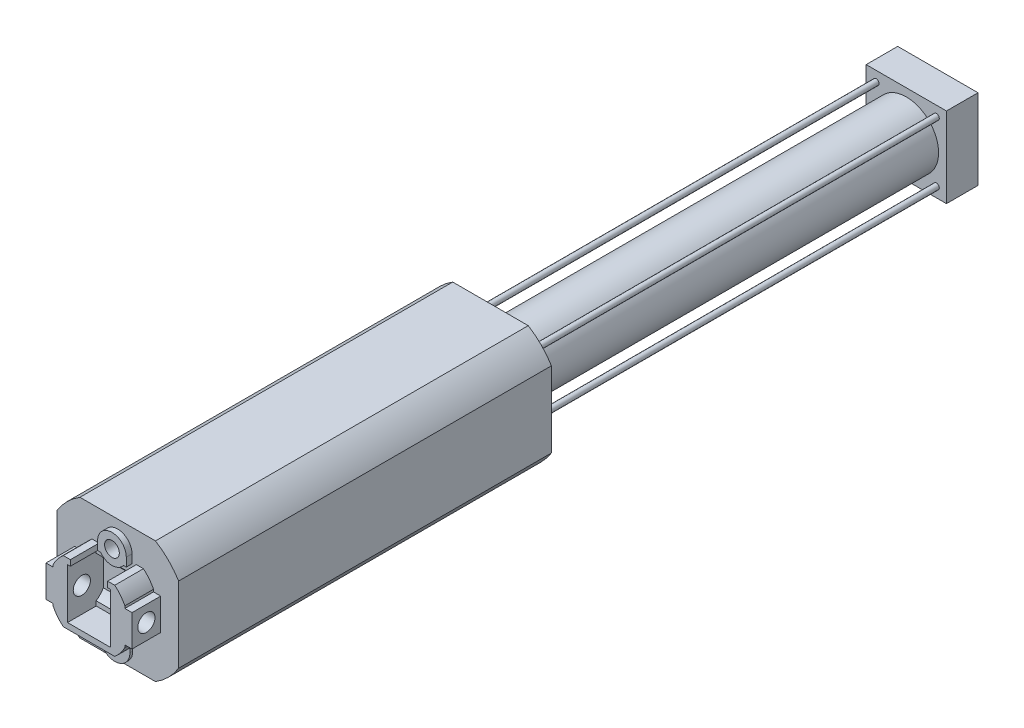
ISO-10303-21;
HEADER;
FILE_DESCRIPTION(('STEP AP214'),'2;1');
FILE_NAME('part.step','',(''),(''),'','','');
FILE_SCHEMA(('AUTOMOTIVE_DESIGN { 1 0 10303 214 1 1 1 1 }'));
ENDSEC;
DATA;
#1=APPLICATION_CONTEXT('core data for automotive mechanical design processes');
#2=APPLICATION_PROTOCOL_DEFINITION('international standard','automotive_design',2000,#1);
#3=PRODUCT_CONTEXT('',#1,'mechanical');
#4=PRODUCT('Part','Part','',(#3));
#5=PRODUCT_RELATED_PRODUCT_CATEGORY('part','',(#4));
#6=PRODUCT_DEFINITION_FORMATION('','',#4);
#7=PRODUCT_DEFINITION_CONTEXT('part definition',#1,'design');
#8=PRODUCT_DEFINITION('design','',#6,#7);
#9=PRODUCT_DEFINITION_SHAPE('','',#8);
#10=(LENGTH_UNIT() NAMED_UNIT(*) SI_UNIT(.MILLI.,.METRE.));
#11=(NAMED_UNIT(*) PLANE_ANGLE_UNIT() SI_UNIT($,.RADIAN.));
#12=(NAMED_UNIT(*) SI_UNIT($,.STERADIAN.) SOLID_ANGLE_UNIT());
#13=UNCERTAINTY_MEASURE_WITH_UNIT(LENGTH_MEASURE(1.E-05),#10,'distance_accuracy_value','');
#14=(GEOMETRIC_REPRESENTATION_CONTEXT(3) GLOBAL_UNCERTAINTY_ASSIGNED_CONTEXT((#13)) GLOBAL_UNIT_ASSIGNED_CONTEXT((#10,
#11,#12)) REPRESENTATION_CONTEXT('',''));
#15=CARTESIAN_POINT('',(0.,0.,0.));
#16=DIRECTION('',(0.,0.,1.));
#17=DIRECTION('',(1.,0.,0.));
#18=AXIS2_PLACEMENT_3D('',#15,#16,#17);
#19=CARTESIAN_POINT('',(0.,0.,0.));
#20=DIRECTION('',(0.,0.,1.));
#21=DIRECTION('',(1.,0.,0.));
#22=AXIS2_PLACEMENT_3D('',#19,#20,#21);
#23=PLANE('',#22);
#24=CARTESIAN_POINT('',(-21.,-21.,0.));
#25=DIRECTION('',(0.,0.,1.));
#26=DIRECTION('',(1.,0.,0.));
#27=AXIS2_PLACEMENT_3D('',#24,#25,#26);
#28=CIRCLE('',#27,2.);
#29=CARTESIAN_POINT('',(-19.,-21.,0.));
#30=VERTEX_POINT('',#29);
#31=EDGE_CURVE('E755',#30,#30,#28,.F.);
#32=ORIENTED_EDGE('',*,*,#31,.F.);
#33=EDGE_LOOP('',(#32));
#34=FACE_BOUND('',#33,.T.);
#35=CARTESIAN_POINT('',(21.,21.,0.));
#36=DIRECTION('',(0.,0.,1.));
#37=DIRECTION('',(1.,0.,0.));
#38=AXIS2_PLACEMENT_3D('',#35,#36,#37);
#39=CIRCLE('',#38,2.);
#40=CARTESIAN_POINT('',(23.,21.,0.));
#41=VERTEX_POINT('',#40);
#42=EDGE_CURVE('E743',#41,#41,#39,.F.);
#43=ORIENTED_EDGE('',*,*,#42,.F.);
#44=EDGE_LOOP('',(#43));
#45=FACE_BOUND('',#44,.T.);
#46=DIRECTION('',(0.,-1.,0.));
#47=VECTOR('',#46,1.);
#48=CARTESIAN_POINT('',(-42.5,0.,0.));
#49=LINE('',#48,#47);
#50=CARTESIAN_POINT('',(-42.5,26.3391343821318,0.));
#51=VERTEX_POINT('',#50);
#52=CARTESIAN_POINT('',(-42.5,-26.3391343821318,0.));
#53=VERTEX_POINT('',#52);
#54=EDGE_CURVE('E720',#51,#53,#49,.T.);
#55=ORIENTED_EDGE('',*,*,#54,.F.);
#56=CARTESIAN_POINT('',(0.,0.,0.));
#57=DIRECTION('',(0.,0.,1.));
#58=DIRECTION('',(1.,0.,0.));
#59=AXIS2_PLACEMENT_3D('',#56,#57,#58);
#60=CIRCLE('',#59,50.);
#61=CARTESIAN_POINT('',(-26.3391343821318,42.5,0.));
#62=VERTEX_POINT('',#61);
#63=EDGE_CURVE('E707',#62,#51,#60,.T.);
#64=ORIENTED_EDGE('',*,*,#63,.F.);
#65=DIRECTION('',(-1.,0.,0.));
#66=VECTOR('',#65,1.);
#67=CARTESIAN_POINT('',(0.,42.5,0.));
#68=LINE('',#67,#66);
#69=CARTESIAN_POINT('',(26.3391343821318,42.5,0.));
#70=VERTEX_POINT('',#69);
#71=EDGE_CURVE('E718',#70,#62,#68,.T.);
#72=ORIENTED_EDGE('',*,*,#71,.F.);
#73=CARTESIAN_POINT('',(42.5,26.3391343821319,0.));
#74=VERTEX_POINT('',#73);
#75=EDGE_CURVE('E704',#74,#70,#60,.T.);
#76=ORIENTED_EDGE('',*,*,#75,.F.);
#77=DIRECTION('',(0.,1.,0.));
#78=VECTOR('',#77,1.);
#79=CARTESIAN_POINT('',(42.5,0.,0.));
#80=LINE('',#79,#78);
#81=CARTESIAN_POINT('',(42.5,-26.3391343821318,0.));
#82=VERTEX_POINT('',#81);
#83=EDGE_CURVE('E716',#82,#74,#80,.T.);
#84=ORIENTED_EDGE('',*,*,#83,.F.);
#85=CARTESIAN_POINT('',(26.3391343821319,-42.5,0.));
#86=VERTEX_POINT('',#85);
#87=EDGE_CURVE('E703',#86,#82,#60,.T.);
#88=ORIENTED_EDGE('',*,*,#87,.F.);
#89=DIRECTION('',(1.,0.,0.));
#90=VECTOR('',#89,1.);
#91=CARTESIAN_POINT('',(0.,-42.5,0.));
#92=LINE('',#91,#90);
#93=CARTESIAN_POINT('',(-26.3391343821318,-42.5,0.));
#94=VERTEX_POINT('',#93);
#95=EDGE_CURVE('E712',#94,#86,#92,.T.);
#96=ORIENTED_EDGE('',*,*,#95,.F.);
#97=EDGE_CURVE('E1622',#53,#94,#60,.T.);
#98=ORIENTED_EDGE('',*,*,#97,.F.);
#99=EDGE_LOOP('',(#55,#64,#72,#76,#84,#88,#96,#98));
#100=FACE_BOUND('',#99,.T.);
#101=CARTESIAN_POINT('',(0.,0.,0.));
#102=DIRECTION('',(0.,0.,1.));
#103=DIRECTION('',(1.,0.,0.));
#104=AXIS2_PLACEMENT_3D('',#101,#102,#103);
#105=CIRCLE('',#104,22.5);
#106=CARTESIAN_POINT('',(22.5,0.,0.));
#107=VERTEX_POINT('',#106);
#108=EDGE_CURVE('E737',#107,#107,#105,.F.);
#109=ORIENTED_EDGE('',*,*,#108,.F.);
#110=EDGE_LOOP('',(#109));
#111=FACE_BOUND('',#110,.T.);
#112=CARTESIAN_POINT('',(-21.,21.,0.));
#113=DIRECTION('',(0.,0.,1.));
#114=DIRECTION('',(1.,0.,0.));
#115=AXIS2_PLACEMENT_3D('',#112,#113,#114);
#116=CIRCLE('',#115,2.);
#117=CARTESIAN_POINT('',(-19.,21.,0.));
#118=VERTEX_POINT('',#117);
#119=EDGE_CURVE('E749',#118,#118,#116,.F.);
#120=ORIENTED_EDGE('',*,*,#119,.F.);
#121=EDGE_LOOP('',(#120));
#122=FACE_BOUND('',#121,.T.);
#123=CARTESIAN_POINT('',(21.,-21.,0.));
#124=DIRECTION('',(0.,0.,1.));
#125=DIRECTION('',(1.,0.,0.));
#126=AXIS2_PLACEMENT_3D('',#123,#124,#125);
#127=CIRCLE('',#126,2.);
#128=CARTESIAN_POINT('',(23.,-21.,0.));
#129=VERTEX_POINT('',#128);
#130=EDGE_CURVE('E12',#129,#129,#127,.F.);
#131=ORIENTED_EDGE('',*,*,#130,.F.);
#132=EDGE_LOOP('',(#131));
#133=FACE_BOUND('',#132,.T.);
#134=ADVANCED_FACE('F39',(#34,#45,#100,#111,#122,#133),#23,.F.);
#135=CARTESIAN_POINT('',(28.,-28.,-290.));
#136=DIRECTION('',(0.,0.,-1.));
#137=DIRECTION('',(-1.,0.,0.));
#138=AXIS2_PLACEMENT_3D('',#135,#136,#137);
#139=PLANE('',#138);
#140=CARTESIAN_POINT('',(-21.,-21.,-290.));
#141=DIRECTION('',(0.,0.,-1.));
#142=DIRECTION('',(-1.,0.,0.));
#143=AXIS2_PLACEMENT_3D('',#140,#141,#142);
#144=CIRCLE('',#143,2.);
#145=CARTESIAN_POINT('',(-23.,-21.,-290.));
#146=VERTEX_POINT('',#145);
#147=EDGE_CURVE('E752',#146,#146,#144,.F.);
#148=ORIENTED_EDGE('',*,*,#147,.F.);
#149=EDGE_LOOP('',(#148));
#150=FACE_BOUND('',#149,.T.);
#151=CARTESIAN_POINT('',(21.,21.,-290.));
#152=DIRECTION('',(0.,0.,-1.));
#153=DIRECTION('',(-1.,0.,0.));
#154=AXIS2_PLACEMENT_3D('',#151,#152,#153);
#155=CIRCLE('',#154,2.);
#156=CARTESIAN_POINT('',(19.,21.,-290.));
#157=VERTEX_POINT('',#156);
#158=EDGE_CURVE('E740',#157,#157,#155,.F.);
#159=ORIENTED_EDGE('',*,*,#158,.F.);
#160=EDGE_LOOP('',(#159));
#161=FACE_BOUND('',#160,.T.);
#162=DIRECTION('',(0.,-1.,0.));
#163=VECTOR('',#162,1.);
#164=CARTESIAN_POINT('',(28.,28.,-290.));
#165=LINE('',#164,#163);
#166=CARTESIAN_POINT('',(28.,28.,-290.));
#167=VERTEX_POINT('',#166);
#168=CARTESIAN_POINT('',(28.,-28.,-290.));
#169=VERTEX_POINT('',#168);
#170=EDGE_CURVE('E365',#167,#169,#165,.T.);
#171=ORIENTED_EDGE('',*,*,#170,.F.);
#172=DIRECTION('',(1.,0.,0.));
#173=VECTOR('',#172,1.);
#174=CARTESIAN_POINT('',(28.,28.,-290.));
#175=LINE('',#174,#173);
#176=CARTESIAN_POINT('',(-28.,28.,-290.));
#177=VERTEX_POINT('',#176);
#178=EDGE_CURVE('E394',#177,#167,#175,.T.);
#179=ORIENTED_EDGE('',*,*,#178,.F.);
#180=DIRECTION('',(0.,1.,0.));
#181=VECTOR('',#180,1.);
#182=CARTESIAN_POINT('',(-28.,28.,-290.));
#183=LINE('',#182,#181);
#184=CARTESIAN_POINT('',(-28.,-28.,-290.));
#185=VERTEX_POINT('',#184);
#186=EDGE_CURVE('E366',#185,#177,#183,.T.);
#187=ORIENTED_EDGE('',*,*,#186,.F.);
#188=DIRECTION('',(-1.,0.,0.));
#189=VECTOR('',#188,1.);
#190=CARTESIAN_POINT('',(28.,-28.,-290.));
#191=LINE('',#190,#189);
#192=EDGE_CURVE('E359',#169,#185,#191,.T.);
#193=ORIENTED_EDGE('',*,*,#192,.F.);
#194=EDGE_LOOP('',(#171,#179,#187,#193));
#195=FACE_BOUND('',#194,.T.);
#196=CARTESIAN_POINT('',(0.,0.,-290.));
#197=DIRECTION('',(0.,0.,-1.));
#198=DIRECTION('',(-1.,0.,0.));
#199=AXIS2_PLACEMENT_3D('',#196,#197,#198);
#200=CIRCLE('',#199,22.5);
#201=CARTESIAN_POINT('',(-22.5,0.,-290.));
#202=VERTEX_POINT('',#201);
#203=EDGE_CURVE('E378',#202,#202,#200,.T.);
#204=ORIENTED_EDGE('',*,*,#203,.T.);
#205=EDGE_LOOP('',(#204));
#206=FACE_BOUND('',#205,.T.);
#207=CARTESIAN_POINT('',(-21.,21.,-290.));
#208=DIRECTION('',(0.,0.,-1.));
#209=DIRECTION('',(-1.,0.,0.));
#210=AXIS2_PLACEMENT_3D('',#207,#208,#209);
#211=CIRCLE('',#210,2.);
#212=CARTESIAN_POINT('',(-23.,21.,-290.));
#213=VERTEX_POINT('',#212);
#214=EDGE_CURVE('E746',#213,#213,#211,.F.);
#215=ORIENTED_EDGE('',*,*,#214,.F.);
#216=EDGE_LOOP('',(#215));
#217=FACE_BOUND('',#216,.T.);
#218=CARTESIAN_POINT('',(21.,-21.,-290.));
#219=DIRECTION('',(0.,0.,-1.));
#220=DIRECTION('',(-1.,0.,0.));
#221=AXIS2_PLACEMENT_3D('',#218,#219,#220);
#222=CIRCLE('',#221,2.);
#223=CARTESIAN_POINT('',(19.,-21.,-290.));
#224=VERTEX_POINT('',#223);
#225=EDGE_CURVE('E48',#224,#224,#222,.F.);
#226=ORIENTED_EDGE('',*,*,#225,.F.);
#227=EDGE_LOOP('',(#226));
#228=FACE_BOUND('',#227,.T.);
#229=ADVANCED_FACE('F361',(#150,#161,#195,#206,#217,#228),#139,.F.);
#230=CARTESIAN_POINT('',(28.,-28.,-312.));
#231=DIRECTION('',(0.,0.,-1.));
#232=DIRECTION('',(-1.,0.,0.));
#233=AXIS2_PLACEMENT_3D('',#230,#231,#232);
#234=PLANE('',#233);
#235=DIRECTION('',(0.,-1.,0.));
#236=VECTOR('',#235,1.);
#237=CARTESIAN_POINT('',(28.,28.,-312.));
#238=LINE('',#237,#236);
#239=CARTESIAN_POINT('',(28.,28.,-312.));
#240=VERTEX_POINT('',#239);
#241=CARTESIAN_POINT('',(28.,-28.,-312.));
#242=VERTEX_POINT('',#241);
#243=EDGE_CURVE('E396',#240,#242,#238,.T.);
#244=ORIENTED_EDGE('',*,*,#243,.T.);
#245=DIRECTION('',(-1.,0.,0.));
#246=VECTOR('',#245,1.);
#247=CARTESIAN_POINT('',(28.,-28.,-312.));
#248=LINE('',#247,#246);
#249=CARTESIAN_POINT('',(-28.,-28.,-312.));
#250=VERTEX_POINT('',#249);
#251=EDGE_CURVE('E374',#242,#250,#248,.T.);
#252=ORIENTED_EDGE('',*,*,#251,.T.);
#253=DIRECTION('',(0.,1.,0.));
#254=VECTOR('',#253,1.);
#255=CARTESIAN_POINT('',(-28.,28.,-312.));
#256=LINE('',#255,#254);
#257=CARTESIAN_POINT('',(-28.,28.,-312.));
#258=VERTEX_POINT('',#257);
#259=EDGE_CURVE('E399',#250,#258,#256,.T.);
#260=ORIENTED_EDGE('',*,*,#259,.T.);
#261=DIRECTION('',(1.,0.,0.));
#262=VECTOR('',#261,1.);
#263=CARTESIAN_POINT('',(28.,28.,-312.));
#264=LINE('',#263,#262);
#265=EDGE_CURVE('E401',#258,#240,#264,.T.);
#266=ORIENTED_EDGE('',*,*,#265,.T.);
#267=EDGE_LOOP('',(#244,#252,#260,#266));
#268=FACE_BOUND('',#267,.T.);
#269=CARTESIAN_POINT('',(0.,0.,-312.));
#270=DIRECTION('',(0.,0.,-1.));
#271=DIRECTION('',(-1.,0.,0.));
#272=AXIS2_PLACEMENT_3D('',#269,#270,#271);
#273=CIRCLE('',#272,14.);
#274=CARTESIAN_POINT('',(-14.,0.,-312.));
#275=VERTEX_POINT('',#274);
#276=EDGE_CURVE('E389',#275,#275,#273,.T.);
#277=ORIENTED_EDGE('',*,*,#276,.F.);
#278=EDGE_LOOP('',(#277));
#279=FACE_BOUND('',#278,.T.);
#280=ADVANCED_FACE('F765',(#268,#279),#234,.T.);
#281=CARTESIAN_POINT('',(0.,0.,260.));
#282=DIRECTION('',(0.,0.,1.));
#283=DIRECTION('',(1.,0.,0.));
#284=AXIS2_PLACEMENT_3D('',#281,#282,#283);
#285=PLANE('',#284);
#286=DIRECTION('',(1.,0.,0.));
#287=VECTOR('',#286,1.);
#288=CARTESIAN_POINT('',(-25.,-21.5,260.));
#289=LINE('',#288,#287);
#290=CARTESIAN_POINT('',(10.5,-21.5,260.));
#291=VERTEX_POINT('',#290);
#292=CARTESIAN_POINT('',(17.9373911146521,-21.5,260.));
#293=VERTEX_POINT('',#292);
#294=EDGE_CURVE('E634',#291,#293,#289,.T.);
#295=ORIENTED_EDGE('',*,*,#294,.F.);
#296=DIRECTION('',(0.,1.,0.));
#297=VECTOR('',#296,1.);
#298=CARTESIAN_POINT('',(10.5,-21.5,260.));
#299=LINE('',#298,#297);
#300=CARTESIAN_POINT('',(10.5,-31.9974802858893,260.));
#301=VERTEX_POINT('',#300);
#302=EDGE_CURVE('E63',#301,#291,#299,.T.);
#303=ORIENTED_EDGE('',*,*,#302,.F.);
#304=CARTESIAN_POINT('',(0.,-31.9974802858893,260.));
#305=DIRECTION('',(0.,0.,1.));
#306=DIRECTION('',(1.,0.,0.));
#307=AXIS2_PLACEMENT_3D('',#304,#305,#306);
#308=CIRCLE('',#307,10.5);
#309=CARTESIAN_POINT('',(-10.5,-31.9974802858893,260.));
#310=VERTEX_POINT('',#309);
#311=EDGE_CURVE('E463',#310,#301,#308,.T.);
#312=ORIENTED_EDGE('',*,*,#311,.F.);
#313=DIRECTION('',(0.,-1.,0.));
#314=VECTOR('',#313,1.);
#315=CARTESIAN_POINT('',(-10.5,-31.9974802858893,260.));
#316=LINE('',#315,#314);
#317=CARTESIAN_POINT('',(-10.5,-21.5,260.));
#318=VERTEX_POINT('',#317);
#319=EDGE_CURVE('E467',#318,#310,#316,.T.);
#320=ORIENTED_EDGE('',*,*,#319,.F.);
#321=CARTESIAN_POINT('',(-17.9373911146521,-21.5,260.));
#322=VERTEX_POINT('',#321);
#323=EDGE_CURVE('E635',#322,#318,#289,.T.);
#324=ORIENTED_EDGE('',*,*,#323,.F.);
#325=CARTESIAN_POINT('',(0.,0.,260.));
#326=DIRECTION('',(0.,0.,1.));
#327=DIRECTION('',(1.,0.,0.));
#328=AXIS2_PLACEMENT_3D('',#325,#326,#327);
#329=CIRCLE('',#328,28.);
#330=CARTESIAN_POINT('',(-25.,-12.6095202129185,260.));
#331=VERTEX_POINT('',#330);
#332=EDGE_CURVE('E1065',#331,#322,#329,.T.);
#333=ORIENTED_EDGE('',*,*,#332,.F.);
#334=DIRECTION('',(0.,-1.,0.));
#335=VECTOR('',#334,1.);
#336=CARTESIAN_POINT('',(-25.,21.5,260.));
#337=LINE('',#336,#335);
#338=CARTESIAN_POINT('',(-25.,-11.,260.));
#339=VERTEX_POINT('',#338);
#340=EDGE_CURVE('E615',#339,#331,#337,.T.);
#341=ORIENTED_EDGE('',*,*,#340,.F.);
#342=DIRECTION('',(1.,0.,0.));
#343=VECTOR('',#342,1.);
#344=CARTESIAN_POINT('',(-30.,-11.,260.));
#345=LINE('',#344,#343);
#346=CARTESIAN_POINT('',(-30.,-11.,260.));
#347=VERTEX_POINT('',#346);
#348=EDGE_CURVE('E546',#347,#339,#345,.T.);
#349=ORIENTED_EDGE('',*,*,#348,.F.);
#350=DIRECTION('',(0.,-1.,0.));
#351=VECTOR('',#350,1.);
#352=CARTESIAN_POINT('',(-30.,11.,260.));
#353=LINE('',#352,#351);
#354=CARTESIAN_POINT('',(-30.,11.,260.));
#355=VERTEX_POINT('',#354);
#356=EDGE_CURVE('E529',#355,#347,#353,.T.);
#357=ORIENTED_EDGE('',*,*,#356,.F.);
#358=DIRECTION('',(1.,0.,0.));
#359=VECTOR('',#358,1.);
#360=CARTESIAN_POINT('',(-30.,11.,260.));
#361=LINE('',#360,#359);
#362=CARTESIAN_POINT('',(-25.,11.,260.));
#363=VERTEX_POINT('',#362);
#364=EDGE_CURVE('E538',#355,#363,#361,.T.);
#365=ORIENTED_EDGE('',*,*,#364,.T.);
#366=CARTESIAN_POINT('',(-25.,12.6095202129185,260.));
#367=VERTEX_POINT('',#366);
#368=EDGE_CURVE('E631',#367,#363,#337,.T.);
#369=ORIENTED_EDGE('',*,*,#368,.F.);
#370=CARTESIAN_POINT('',(-17.9373911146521,21.5,260.));
#371=VERTEX_POINT('',#370);
#372=EDGE_CURVE('E670',#371,#367,#329,.T.);
#373=ORIENTED_EDGE('',*,*,#372,.F.);
#374=DIRECTION('',(-1.,0.,0.));
#375=VECTOR('',#374,1.);
#376=CARTESIAN_POINT('',(-25.,21.5,260.));
#377=LINE('',#376,#375);
#378=CARTESIAN_POINT('',(-13.,21.5,260.));
#379=VERTEX_POINT('',#378);
#380=EDGE_CURVE('E642',#379,#371,#377,.T.);
#381=ORIENTED_EDGE('',*,*,#380,.F.);
#382=DIRECTION('',(0.,-1.,0.));
#383=VECTOR('',#382,1.);
#384=CARTESIAN_POINT('',(-13.,21.5,260.));
#385=LINE('',#384,#383);
#386=CARTESIAN_POINT('',(-13.,17.5,260.));
#387=VERTEX_POINT('',#386);
#388=EDGE_CURVE('E589',#379,#387,#385,.T.);
#389=ORIENTED_EDGE('',*,*,#388,.T.);
#390=DIRECTION('',(-1.,0.,0.));
#391=VECTOR('',#390,1.);
#392=CARTESIAN_POINT('',(-13.,17.5,260.));
#393=LINE('',#392,#391);
#394=CARTESIAN_POINT('',(-15.,17.5,260.));
#395=VERTEX_POINT('',#394);
#396=EDGE_CURVE('E592',#387,#395,#393,.T.);
#397=ORIENTED_EDGE('',*,*,#396,.T.);
#398=DIRECTION('',(0.,-1.,0.));
#399=VECTOR('',#398,1.);
#400=CARTESIAN_POINT('',(-15.,17.5,260.));
#401=LINE('',#400,#399);
#402=CARTESIAN_POINT('',(-15.,14.3614066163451,260.));
#403=VERTEX_POINT('',#402);
#404=EDGE_CURVE('E596',#395,#403,#401,.T.);
#405=ORIENTED_EDGE('',*,*,#404,.T.);
#406=DIRECTION('',(-1.,0.,0.));
#407=VECTOR('',#406,1.);
#408=CARTESIAN_POINT('',(15.,14.3614066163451,260.));
#409=LINE('',#408,#407);
#410=CARTESIAN_POINT('',(15.,14.3614066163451,260.));
#411=VERTEX_POINT('',#410);
#412=EDGE_CURVE('E510',#403,#411,#409,.F.);
#413=ORIENTED_EDGE('',*,*,#412,.T.);
#414=DIRECTION('',(0.,1.,0.));
#415=VECTOR('',#414,1.);
#416=CARTESIAN_POINT('',(15.,-17.5,260.));
#417=LINE('',#416,#415);
#418=CARTESIAN_POINT('',(15.,17.5,260.));
#419=VERTEX_POINT('',#418);
#420=EDGE_CURVE('E602',#411,#419,#417,.T.);
#421=ORIENTED_EDGE('',*,*,#420,.T.);
#422=DIRECTION('',(-1.,0.,0.));
#423=VECTOR('',#422,1.);
#424=CARTESIAN_POINT('',(15.,17.5,260.));
#425=LINE('',#424,#423);
#426=CARTESIAN_POINT('',(13.,17.5,260.));
#427=VERTEX_POINT('',#426);
#428=EDGE_CURVE('E606',#419,#427,#425,.T.);
#429=ORIENTED_EDGE('',*,*,#428,.T.);
#430=DIRECTION('',(0.,1.,0.));
#431=VECTOR('',#430,1.);
#432=CARTESIAN_POINT('',(13.,17.5,260.));
#433=LINE('',#432,#431);
#434=CARTESIAN_POINT('',(13.,21.5,260.));
#435=VERTEX_POINT('',#434);
#436=EDGE_CURVE('E609',#427,#435,#433,.T.);
#437=ORIENTED_EDGE('',*,*,#436,.T.);
#438=CARTESIAN_POINT('',(17.9373911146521,21.5,260.));
#439=VERTEX_POINT('',#438);
#440=EDGE_CURVE('E643',#439,#435,#377,.T.);
#441=ORIENTED_EDGE('',*,*,#440,.F.);
#442=CARTESIAN_POINT('',(25.,12.6095202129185,260.));
#443=VERTEX_POINT('',#442);
#444=EDGE_CURVE('E666',#443,#439,#329,.T.);
#445=ORIENTED_EDGE('',*,*,#444,.F.);
#446=DIRECTION('',(0.,1.,0.));
#447=VECTOR('',#446,1.);
#448=CARTESIAN_POINT('',(25.,21.5,260.));
#449=LINE('',#448,#447);
#450=CARTESIAN_POINT('',(25.,11.,260.));
#451=VERTEX_POINT('',#450);
#452=EDGE_CURVE('E638',#451,#443,#449,.T.);
#453=ORIENTED_EDGE('',*,*,#452,.F.);
#454=DIRECTION('',(-1.,0.,0.));
#455=VECTOR('',#454,1.);
#456=CARTESIAN_POINT('',(30.,11.,260.));
#457=LINE('',#456,#455);
#458=CARTESIAN_POINT('',(30.,11.,260.));
#459=VERTEX_POINT('',#458);
#460=EDGE_CURVE('E564',#459,#451,#457,.T.);
#461=ORIENTED_EDGE('',*,*,#460,.F.);
#462=DIRECTION('',(0.,1.,0.));
#463=VECTOR('',#462,1.);
#464=CARTESIAN_POINT('',(30.,-11.,260.));
#465=LINE('',#464,#463);
#466=CARTESIAN_POINT('',(30.,-11.,260.));
#467=VERTEX_POINT('',#466);
#468=EDGE_CURVE('E557',#467,#459,#465,.T.);
#469=ORIENTED_EDGE('',*,*,#468,.F.);
#470=DIRECTION('',(-1.,0.,0.));
#471=VECTOR('',#470,1.);
#472=CARTESIAN_POINT('',(30.,-11.,260.));
#473=LINE('',#472,#471);
#474=CARTESIAN_POINT('',(25.,-11.,260.));
#475=VERTEX_POINT('',#474);
#476=EDGE_CURVE('E566',#467,#475,#473,.T.);
#477=ORIENTED_EDGE('',*,*,#476,.T.);
#478=CARTESIAN_POINT('',(25.,-12.6095202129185,260.));
#479=VERTEX_POINT('',#478);
#480=EDGE_CURVE('E639',#479,#475,#449,.T.);
#481=ORIENTED_EDGE('',*,*,#480,.F.);
#482=EDGE_CURVE('E665',#293,#479,#329,.T.);
#483=ORIENTED_EDGE('',*,*,#482,.F.);
#484=EDGE_LOOP('',(#295,#303,#312,#320,#324,#333,#341,#349,#357,#365,#369,#373,#381,#389,#397,
#405,#413,#421,#429,#437,#441,#445,#453,#461,#469,#477,#481,#483));
#485=FACE_BOUND('',#484,.T.);
#486=CARTESIAN_POINT('',(0.,0.,260.));
#487=DIRECTION('',(0.,0.,1.));
#488=DIRECTION('',(1.,0.,0.));
#489=AXIS2_PLACEMENT_3D('',#486,#487,#488);
#490=CIRCLE('',#489,50.);
#491=CARTESIAN_POINT('',(-26.3391343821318,42.5,260.));
#492=VERTEX_POINT('',#491);
#493=CARTESIAN_POINT('',(-42.5,26.3391343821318,260.));
#494=VERTEX_POINT('',#493);
#495=EDGE_CURVE('E713',#492,#494,#490,.T.);
#496=ORIENTED_EDGE('',*,*,#495,.T.);
#497=DIRECTION('',(0.,-1.,0.));
#498=VECTOR('',#497,1.);
#499=CARTESIAN_POINT('',(-42.5,42.5,260.));
#500=LINE('',#499,#498);
#501=CARTESIAN_POINT('',(-42.5,-26.3391343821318,260.));
#502=VERTEX_POINT('',#501);
#503=EDGE_CURVE('E674',#494,#502,#500,.T.);
#504=ORIENTED_EDGE('',*,*,#503,.T.);
#505=CARTESIAN_POINT('',(-26.3391343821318,-42.5,260.));
#506=VERTEX_POINT('',#505);
#507=EDGE_CURVE('E1594',#502,#506,#490,.T.);
#508=ORIENTED_EDGE('',*,*,#507,.T.);
#509=DIRECTION('',(1.,0.,0.));
#510=VECTOR('',#509,1.);
#511=CARTESIAN_POINT('',(-42.5,-42.5,260.));
#512=LINE('',#511,#510);
#513=CARTESIAN_POINT('',(26.3391343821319,-42.5,260.));
#514=VERTEX_POINT('',#513);
#515=EDGE_CURVE('E678',#506,#514,#512,.T.);
#516=ORIENTED_EDGE('',*,*,#515,.T.);
#517=CARTESIAN_POINT('',(42.5,-26.3391343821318,260.));
#518=VERTEX_POINT('',#517);
#519=EDGE_CURVE('E706',#514,#518,#490,.T.);
#520=ORIENTED_EDGE('',*,*,#519,.T.);
#521=DIRECTION('',(0.,1.,0.));
#522=VECTOR('',#521,1.);
#523=CARTESIAN_POINT('',(42.5,42.5,260.));
#524=LINE('',#523,#522);
#525=CARTESIAN_POINT('',(42.5,26.3391343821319,260.));
#526=VERTEX_POINT('',#525);
#527=EDGE_CURVE('E681',#518,#526,#524,.T.);
#528=ORIENTED_EDGE('',*,*,#527,.T.);
#529=CARTESIAN_POINT('',(26.3391343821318,42.5,260.));
#530=VERTEX_POINT('',#529);
#531=EDGE_CURVE('E708',#526,#530,#490,.T.);
#532=ORIENTED_EDGE('',*,*,#531,.T.);
#533=DIRECTION('',(-1.,0.,0.));
#534=VECTOR('',#533,1.);
#535=CARTESIAN_POINT('',(-42.5,42.5,260.));
#536=LINE('',#535,#534);
#537=EDGE_CURVE('E684',#530,#492,#536,.T.);
#538=ORIENTED_EDGE('',*,*,#537,.T.);
#539=EDGE_LOOP('',(#496,#504,#508,#516,#520,#528,#532,#538));
#540=FACE_BOUND('',#539,.T.);
#541=DIRECTION('',(1.,0.,0.));
#542=VECTOR('',#541,1.);
#543=CARTESIAN_POINT('',(7.99999999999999,20.5,260.));
#544=LINE('',#543,#542);
#545=CARTESIAN_POINT('',(7.99999999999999,20.5,260.));
#546=VERTEX_POINT('',#545);
#547=CARTESIAN_POINT('',(10.,20.5,260.));
#548=VERTEX_POINT('',#547);
#549=EDGE_CURVE('E425',#546,#548,#544,.T.);
#550=ORIENTED_EDGE('',*,*,#549,.F.);
#551=CARTESIAN_POINT('',(0.,26.5,260.));
#552=DIRECTION('',(0.,0.,1.));
#553=DIRECTION('',(1.,0.,0.));
#554=AXIS2_PLACEMENT_3D('',#551,#552,#553);
#555=CIRCLE('',#554,10.);
#556=CARTESIAN_POINT('',(-7.99999999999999,20.5,260.));
#557=VERTEX_POINT('',#556);
#558=EDGE_CURVE('E422',#557,#546,#555,.T.);
#559=ORIENTED_EDGE('',*,*,#558,.F.);
#560=DIRECTION('',(1.,0.,0.));
#561=VECTOR('',#560,1.);
#562=CARTESIAN_POINT('',(-10.,20.5,260.));
#563=LINE('',#562,#561);
#564=CARTESIAN_POINT('',(-10.,20.5,260.));
#565=VERTEX_POINT('',#564);
#566=EDGE_CURVE('E433',#565,#557,#563,.T.);
#567=ORIENTED_EDGE('',*,*,#566,.F.);
#568=DIRECTION('',(0.,-1.,0.));
#569=VECTOR('',#568,1.);
#570=CARTESIAN_POINT('',(-10.,26.5,260.));
#571=LINE('',#570,#569);
#572=CARTESIAN_POINT('',(-10.,26.5,260.));
#573=VERTEX_POINT('',#572);
#574=EDGE_CURVE('E431',#573,#565,#571,.T.);
#575=ORIENTED_EDGE('',*,*,#574,.F.);
#576=CARTESIAN_POINT('',(0.,26.5,260.));
#577=DIRECTION('',(0.,0.,1.));
#578=DIRECTION('',(1.,0.,0.));
#579=AXIS2_PLACEMENT_3D('',#576,#577,#578);
#580=CIRCLE('',#579,10.);
#581=CARTESIAN_POINT('',(10.,26.5,260.));
#582=VERTEX_POINT('',#581);
#583=EDGE_CURVE('E429',#582,#573,#580,.T.);
#584=ORIENTED_EDGE('',*,*,#583,.F.);
#585=DIRECTION('',(0.,1.,0.));
#586=VECTOR('',#585,1.);
#587=CARTESIAN_POINT('',(10.,26.5,260.));
#588=LINE('',#587,#586);
#589=EDGE_CURVE('E427',#548,#582,#588,.T.);
#590=ORIENTED_EDGE('',*,*,#589,.F.);
#591=EDGE_LOOP('',(#550,#559,#567,#575,#584,#590));
#592=FACE_BOUND('',#591,.T.);
#593=ADVANCED_FACE('F772',(#485,#540,#592),#285,.T.);
#594=CARTESIAN_POINT('',(-25.,-21.5,260.));
#595=DIRECTION('',(0.,-1.,0.));
#596=DIRECTION('',(0.,0.,-1.));
#597=AXIS2_PLACEMENT_3D('',#594,#595,#596);
#598=PLANE('',#597);
#599=DIRECTION('',(-1.,0.,0.));
#600=VECTOR('',#599,1.);
#601=CARTESIAN_POINT('',(-10.5,-21.5,262.));
#602=LINE('',#601,#600);
#603=CARTESIAN_POINT('',(10.5,-21.5,262.));
#604=VERTEX_POINT('',#603);
#605=CARTESIAN_POINT('',(-10.5,-21.5,262.));
#606=VERTEX_POINT('',#605);
#607=EDGE_CURVE('E476',#604,#606,#602,.T.);
#608=ORIENTED_EDGE('',*,*,#607,.F.);
#609=DIRECTION('',(0.,0.,-1.));
#610=VECTOR('',#609,1.);
#611=CARTESIAN_POINT('',(10.5,-21.5,262.));
#612=LINE('',#611,#610);
#613=EDGE_CURVE('E487',#604,#291,#612,.T.);
#614=ORIENTED_EDGE('',*,*,#613,.T.);
#615=ORIENTED_EDGE('',*,*,#294,.T.);
#616=DIRECTION('',(0.,0.,-1.));
#617=VECTOR('',#616,1.);
#618=CARTESIAN_POINT('',(17.9373911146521,-21.5,280.));
#619=LINE('',#618,#617);
#620=CARTESIAN_POINT('',(17.9373911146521,-21.5,280.));
#621=VERTEX_POINT('',#620);
#622=EDGE_CURVE('E646',#293,#621,#619,.F.);
#623=ORIENTED_EDGE('',*,*,#622,.T.);
#624=DIRECTION('',(1.,0.,0.));
#625=VECTOR('',#624,1.);
#626=CARTESIAN_POINT('',(0.,-21.5,280.));
#627=LINE('',#626,#625);
#628=CARTESIAN_POINT('',(-17.9373911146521,-21.5,280.));
#629=VERTEX_POINT('',#628);
#630=EDGE_CURVE('E722',#629,#621,#627,.T.);
#631=ORIENTED_EDGE('',*,*,#630,.F.);
#632=DIRECTION('',(0.,0.,-1.));
#633=VECTOR('',#632,1.);
#634=CARTESIAN_POINT('',(-17.9373911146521,-21.5,280.));
#635=LINE('',#634,#633);
#636=EDGE_CURVE('E648',#629,#322,#635,.T.);
#637=ORIENTED_EDGE('',*,*,#636,.T.);
#638=ORIENTED_EDGE('',*,*,#323,.T.);
#639=DIRECTION('',(0.,0.,-1.));
#640=VECTOR('',#639,1.);
#641=CARTESIAN_POINT('',(-10.5,-21.5,262.));
#642=LINE('',#641,#640);
#643=EDGE_CURVE('E484',#606,#318,#642,.T.);
#644=ORIENTED_EDGE('',*,*,#643,.F.);
#645=EDGE_LOOP('',(#608,#614,#615,#623,#631,#637,#638,#644));
#646=FACE_BOUND('',#645,.T.);
#647=ADVANCED_FACE('F936',(#646),#598,.T.);
#648=CARTESIAN_POINT('',(15.,-17.5,260.));
#649=VERTEX_POINT('',#648);
#650=CARTESIAN_POINT('',(15.,-14.3614066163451,260.));
#651=VERTEX_POINT('',#650);
#652=EDGE_CURVE('E603',#649,#651,#417,.T.);
#653=ORIENTED_EDGE('',*,*,#652,.T.);
#654=DIRECTION('',(-1.,0.,0.));
#655=VECTOR('',#654,1.);
#656=CARTESIAN_POINT('',(15.,-14.3614066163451,260.));
#657=LINE('',#656,#655);
#658=CARTESIAN_POINT('',(-15.,-14.3614066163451,260.));
#659=VERTEX_POINT('',#658);
#660=EDGE_CURVE('E507',#651,#659,#657,.T.);
#661=ORIENTED_EDGE('',*,*,#660,.T.);
#662=CARTESIAN_POINT('',(-15.,-17.5,260.));
#663=VERTEX_POINT('',#662);
#664=EDGE_CURVE('E595',#659,#663,#401,.T.);
#665=ORIENTED_EDGE('',*,*,#664,.T.);
#666=DIRECTION('',(1.,0.,0.));
#667=VECTOR('',#666,1.);
#668=CARTESIAN_POINT('',(-15.,-17.5,260.));
#669=LINE('',#668,#667);
#670=EDGE_CURVE('E599',#663,#649,#669,.T.);
#671=ORIENTED_EDGE('',*,*,#670,.T.);
#672=EDGE_LOOP('',(#653,#661,#665,#671));
#673=FACE_BOUND('',#672,.T.);
#674=ADVANCED_FACE('F939',(#673),#285,.T.);
#675=CARTESIAN_POINT('',(-25.,21.5,260.));
#676=DIRECTION('',(-1.,0.,0.));
#677=DIRECTION('',(0.,-1.,0.));
#678=AXIS2_PLACEMENT_3D('',#675,#676,#677);
#679=PLANE('',#678);
#680=DIRECTION('',(0.,-1.,0.));
#681=VECTOR('',#680,1.);
#682=CARTESIAN_POINT('',(-25.,0.,280.));
#683=LINE('',#682,#681);
#684=CARTESIAN_POINT('',(-25.,-11.,280.));
#685=VERTEX_POINT('',#684);
#686=CARTESIAN_POINT('',(-25.,-12.6095202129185,280.));
#687=VERTEX_POINT('',#686);
#688=EDGE_CURVE('E733',#685,#687,#683,.T.);
#689=ORIENTED_EDGE('',*,*,#688,.F.);
#690=DIRECTION('',(0.,0.,1.));
#691=VECTOR('',#690,1.);
#692=CARTESIAN_POINT('',(-25.,-11.,260.));
#693=LINE('',#692,#691);
#694=EDGE_CURVE('E525',#339,#685,#693,.T.);
#695=ORIENTED_EDGE('',*,*,#694,.F.);
#696=ORIENTED_EDGE('',*,*,#340,.T.);
#697=DIRECTION('',(0.,0.,-1.));
#698=VECTOR('',#697,1.);
#699=CARTESIAN_POINT('',(-25.,-12.6095202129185,280.));
#700=LINE('',#699,#698);
#701=EDGE_CURVE('E660',#331,#687,#700,.F.);
#702=ORIENTED_EDGE('',*,*,#701,.T.);
#703=EDGE_LOOP('',(#689,#695,#696,#702));
#704=FACE_BOUND('',#703,.T.);
#705=ADVANCED_FACE('F941',(#704),#679,.T.);
#706=ORIENTED_EDGE('',*,*,#368,.T.);
#707=DIRECTION('',(0.,0.,-1.));
#708=VECTOR('',#707,1.);
#709=CARTESIAN_POINT('',(-25.,11.,260.));
#710=LINE('',#709,#708);
#711=CARTESIAN_POINT('',(-25.,11.,280.));
#712=VERTEX_POINT('',#711);
#713=EDGE_CURVE('E527',#712,#363,#710,.T.);
#714=ORIENTED_EDGE('',*,*,#713,.F.);
#715=CARTESIAN_POINT('',(-25.,12.6095202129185,280.));
#716=VERTEX_POINT('',#715);
#717=EDGE_CURVE('E734',#716,#712,#683,.T.);
#718=ORIENTED_EDGE('',*,*,#717,.F.);
#719=DIRECTION('',(0.,0.,-1.));
#720=VECTOR('',#719,1.);
#721=CARTESIAN_POINT('',(-25.,12.6095202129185,280.));
#722=LINE('',#721,#720);
#723=EDGE_CURVE('E663',#716,#367,#722,.T.);
#724=ORIENTED_EDGE('',*,*,#723,.T.);
#725=EDGE_LOOP('',(#706,#714,#718,#724));
#726=FACE_BOUND('',#725,.T.);
#727=ADVANCED_FACE('F934',(#726),#679,.T.);
#728=CARTESIAN_POINT('',(25.,21.5,260.));
#729=DIRECTION('',(1.,0.,0.));
#730=DIRECTION('',(0.,1.,0.));
#731=AXIS2_PLACEMENT_3D('',#728,#729,#730);
#732=PLANE('',#731);
#733=ORIENTED_EDGE('',*,*,#480,.T.);
#734=DIRECTION('',(0.,0.,-1.));
#735=VECTOR('',#734,1.);
#736=CARTESIAN_POINT('',(25.,-11.,280.));
#737=LINE('',#736,#735);
#738=CARTESIAN_POINT('',(25.,-11.,280.));
#739=VERTEX_POINT('',#738);
#740=EDGE_CURVE('E548',#739,#475,#737,.T.);
#741=ORIENTED_EDGE('',*,*,#740,.F.);
#742=DIRECTION('',(0.,1.,0.));
#743=VECTOR('',#742,1.);
#744=CARTESIAN_POINT('',(25.,0.,280.));
#745=LINE('',#744,#743);
#746=CARTESIAN_POINT('',(25.,-12.6095202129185,280.));
#747=VERTEX_POINT('',#746);
#748=EDGE_CURVE('E726',#747,#739,#745,.T.);
#749=ORIENTED_EDGE('',*,*,#748,.F.);
#750=DIRECTION('',(0.,0.,-1.));
#751=VECTOR('',#750,1.);
#752=CARTESIAN_POINT('',(25.,-12.6095202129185,280.));
#753=LINE('',#752,#751);
#754=EDGE_CURVE('E653',#747,#479,#753,.T.);
#755=ORIENTED_EDGE('',*,*,#754,.T.);
#756=EDGE_LOOP('',(#733,#741,#749,#755));
#757=FACE_BOUND('',#756,.T.);
#758=ADVANCED_FACE('F930',(#757),#732,.T.);
#759=CARTESIAN_POINT('',(25.,11.,280.));
#760=VERTEX_POINT('',#759);
#761=CARTESIAN_POINT('',(25.,12.6095202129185,280.));
#762=VERTEX_POINT('',#761);
#763=EDGE_CURVE('E725',#760,#762,#745,.T.);
#764=ORIENTED_EDGE('',*,*,#763,.F.);
#765=DIRECTION('',(0.,0.,1.));
#766=VECTOR('',#765,1.);
#767=CARTESIAN_POINT('',(25.,11.,280.));
#768=LINE('',#767,#766);
#769=EDGE_CURVE('E550',#451,#760,#768,.T.);
#770=ORIENTED_EDGE('',*,*,#769,.F.);
#771=ORIENTED_EDGE('',*,*,#452,.T.);
#772=DIRECTION('',(0.,0.,-1.));
#773=VECTOR('',#772,1.);
#774=CARTESIAN_POINT('',(25.,12.6095202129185,280.));
#775=LINE('',#774,#773);
#776=EDGE_CURVE('E650',#443,#762,#775,.F.);
#777=ORIENTED_EDGE('',*,*,#776,.T.);
#778=EDGE_LOOP('',(#764,#770,#771,#777));
#779=FACE_BOUND('',#778,.T.);
#780=ADVANCED_FACE('F933',(#779),#732,.T.);
#781=CARTESIAN_POINT('',(-25.,21.5,260.));
#782=DIRECTION('',(0.,1.,0.));
#783=DIRECTION('',(0.,0.,1.));
#784=AXIS2_PLACEMENT_3D('',#781,#782,#783);
#785=PLANE('',#784);
#786=DIRECTION('',(0.,0.,1.));
#787=VECTOR('',#786,1.);
#788=CARTESIAN_POINT('',(13.,21.5,260.));
#789=LINE('',#788,#787);
#790=CARTESIAN_POINT('',(13.,21.5,280.));
#791=VERTEX_POINT('',#790);
#792=EDGE_CURVE('E612',#435,#791,#789,.T.);
#793=ORIENTED_EDGE('',*,*,#792,.T.);
#794=DIRECTION('',(-1.,0.,0.));
#795=VECTOR('',#794,1.);
#796=CARTESIAN_POINT('',(0.,21.5,280.));
#797=LINE('',#796,#795);
#798=CARTESIAN_POINT('',(17.9373911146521,21.5,280.));
#799=VERTEX_POINT('',#798);
#800=EDGE_CURVE('E730',#799,#791,#797,.T.);
#801=ORIENTED_EDGE('',*,*,#800,.F.);
#802=DIRECTION('',(0.,0.,-1.));
#803=VECTOR('',#802,1.);
#804=CARTESIAN_POINT('',(17.9373911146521,21.5,280.));
#805=LINE('',#804,#803);
#806=EDGE_CURVE('E658',#799,#439,#805,.T.);
#807=ORIENTED_EDGE('',*,*,#806,.T.);
#808=ORIENTED_EDGE('',*,*,#440,.T.);
#809=EDGE_LOOP('',(#793,#801,#807,#808));
#810=FACE_BOUND('',#809,.T.);
#811=ADVANCED_FACE('F929',(#810),#785,.T.);
#812=CARTESIAN_POINT('',(0.,0.,280.));
#813=DIRECTION('',(0.,0.,-1.));
#814=DIRECTION('',(-1.,0.,0.));
#815=AXIS2_PLACEMENT_3D('',#812,#813,#814);
#816=CYLINDRICAL_SURFACE('',#815,28.);
#817=ORIENTED_EDGE('',*,*,#723,.F.);
#818=CARTESIAN_POINT('',(0.,0.,280.));
#819=DIRECTION('',(0.,0.,1.));
#820=DIRECTION('',(1.,0.,0.));
#821=AXIS2_PLACEMENT_3D('',#818,#819,#820);
#822=CIRCLE('',#821,28.);
#823=CARTESIAN_POINT('',(-17.9373911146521,21.5,280.));
#824=VERTEX_POINT('',#823);
#825=EDGE_CURVE('E675',#824,#716,#822,.T.);
#826=ORIENTED_EDGE('',*,*,#825,.F.);
#827=DIRECTION('',(0.,0.,-1.));
#828=VECTOR('',#827,1.);
#829=CARTESIAN_POINT('',(-17.9373911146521,21.5,280.));
#830=LINE('',#829,#828);
#831=EDGE_CURVE('E655',#371,#824,#830,.F.);
#832=ORIENTED_EDGE('',*,*,#831,.F.);
#833=ORIENTED_EDGE('',*,*,#372,.T.);
#834=EDGE_LOOP('',(#817,#826,#832,#833));
#835=FACE_BOUND('',#834,.T.);
#836=ADVANCED_FACE('F950',(#835),#816,.T.);
#837=ORIENTED_EDGE('',*,*,#701,.F.);
#838=ORIENTED_EDGE('',*,*,#332,.T.);
#839=ORIENTED_EDGE('',*,*,#636,.F.);
#840=EDGE_CURVE('E1038',#687,#629,#822,.T.);
#841=ORIENTED_EDGE('',*,*,#840,.F.);
#842=EDGE_LOOP('',(#837,#838,#839,#841));
#843=FACE_BOUND('',#842,.T.);
#844=ADVANCED_FACE('F953',(#843),#816,.T.);
#845=ORIENTED_EDGE('',*,*,#806,.F.);
#846=EDGE_CURVE('E671',#762,#799,#822,.T.);
#847=ORIENTED_EDGE('',*,*,#846,.F.);
#848=ORIENTED_EDGE('',*,*,#776,.F.);
#849=ORIENTED_EDGE('',*,*,#444,.T.);
#850=EDGE_LOOP('',(#845,#847,#848,#849));
#851=FACE_BOUND('',#850,.T.);
#852=ADVANCED_FACE('F1015',(#851),#816,.T.);
#853=ORIENTED_EDGE('',*,*,#754,.F.);
#854=EDGE_CURVE('E669',#621,#747,#822,.T.);
#855=ORIENTED_EDGE('',*,*,#854,.F.);
#856=ORIENTED_EDGE('',*,*,#622,.F.);
#857=ORIENTED_EDGE('',*,*,#482,.T.);
#858=EDGE_LOOP('',(#853,#855,#856,#857));
#859=FACE_BOUND('',#858,.T.);
#860=ADVANCED_FACE('F948',(#859),#816,.T.);
#861=CARTESIAN_POINT('',(0.,0.,280.));
#862=DIRECTION('',(0.,0.,1.));
#863=DIRECTION('',(1.,0.,0.));
#864=AXIS2_PLACEMENT_3D('',#861,#862,#863);
#865=PLANE('',#864);
#866=DIRECTION('',(0.,1.,0.));
#867=VECTOR('',#866,1.);
#868=CARTESIAN_POINT('',(13.,17.5,280.));
#869=LINE('',#868,#867);
#870=CARTESIAN_POINT('',(13.,17.5,280.));
#871=VERTEX_POINT('',#870);
#872=EDGE_CURVE('E587',#871,#791,#869,.T.);
#873=ORIENTED_EDGE('',*,*,#872,.F.);
#874=DIRECTION('',(-1.,0.,0.));
#875=VECTOR('',#874,1.);
#876=CARTESIAN_POINT('',(15.,17.5,280.));
#877=LINE('',#876,#875);
#878=CARTESIAN_POINT('',(15.,17.5,280.));
#879=VERTEX_POINT('',#878);
#880=EDGE_CURVE('E584',#879,#871,#877,.T.);
#881=ORIENTED_EDGE('',*,*,#880,.F.);
#882=DIRECTION('',(0.,1.,0.));
#883=VECTOR('',#882,1.);
#884=CARTESIAN_POINT('',(15.,-17.5,280.));
#885=LINE('',#884,#883);
#886=CARTESIAN_POINT('',(15.,-17.5,280.));
#887=VERTEX_POINT('',#886);
#888=EDGE_CURVE('E582',#887,#879,#885,.T.);
#889=ORIENTED_EDGE('',*,*,#888,.F.);
#890=DIRECTION('',(1.,0.,0.));
#891=VECTOR('',#890,1.);
#892=CARTESIAN_POINT('',(-15.,-17.5,280.));
#893=LINE('',#892,#891);
#894=CARTESIAN_POINT('',(-15.,-17.5,280.));
#895=VERTEX_POINT('',#894);
#896=EDGE_CURVE('E579',#895,#887,#893,.T.);
#897=ORIENTED_EDGE('',*,*,#896,.F.);
#898=DIRECTION('',(0.,-1.,0.));
#899=VECTOR('',#898,1.);
#900=CARTESIAN_POINT('',(-15.,17.5,280.));
#901=LINE('',#900,#899);
#902=CARTESIAN_POINT('',(-15.,17.5,280.));
#903=VERTEX_POINT('',#902);
#904=EDGE_CURVE('E577',#903,#895,#901,.T.);
#905=ORIENTED_EDGE('',*,*,#904,.F.);
#906=DIRECTION('',(-1.,0.,0.));
#907=VECTOR('',#906,1.);
#908=CARTESIAN_POINT('',(-13.,17.5,280.));
#909=LINE('',#908,#907);
#910=CARTESIAN_POINT('',(-13.,17.5,280.));
#911=VERTEX_POINT('',#910);
#912=EDGE_CURVE('E574',#911,#903,#909,.T.);
#913=ORIENTED_EDGE('',*,*,#912,.F.);
#914=DIRECTION('',(0.,-1.,0.));
#915=VECTOR('',#914,1.);
#916=CARTESIAN_POINT('',(-13.,21.5,280.));
#917=LINE('',#916,#915);
#918=CARTESIAN_POINT('',(-13.,21.5,280.));
#919=VERTEX_POINT('',#918);
#920=EDGE_CURVE('E571',#919,#911,#917,.T.);
#921=ORIENTED_EDGE('',*,*,#920,.F.);
#922=EDGE_CURVE('E729',#919,#824,#797,.T.);
#923=ORIENTED_EDGE('',*,*,#922,.T.);
#924=ORIENTED_EDGE('',*,*,#825,.T.);
#925=ORIENTED_EDGE('',*,*,#717,.T.);
#926=DIRECTION('',(1.,0.,0.));
#927=VECTOR('',#926,1.);
#928=CARTESIAN_POINT('',(-30.,11.,280.));
#929=LINE('',#928,#927);
#930=CARTESIAN_POINT('',(-30.,11.,280.));
#931=VERTEX_POINT('',#930);
#932=EDGE_CURVE('E541',#931,#712,#929,.T.);
#933=ORIENTED_EDGE('',*,*,#932,.F.);
#934=DIRECTION('',(0.,1.,0.));
#935=VECTOR('',#934,1.);
#936=CARTESIAN_POINT('',(-30.,11.,280.));
#937=LINE('',#936,#935);
#938=CARTESIAN_POINT('',(-30.,-11.,280.));
#939=VERTEX_POINT('',#938);
#940=EDGE_CURVE('E534',#939,#931,#937,.T.);
#941=ORIENTED_EDGE('',*,*,#940,.F.);
#942=DIRECTION('',(1.,0.,0.));
#943=VECTOR('',#942,1.);
#944=CARTESIAN_POINT('',(-30.,-11.,280.));
#945=LINE('',#944,#943);
#946=EDGE_CURVE('E543',#939,#685,#945,.T.);
#947=ORIENTED_EDGE('',*,*,#946,.T.);
#948=ORIENTED_EDGE('',*,*,#688,.T.);
#949=ORIENTED_EDGE('',*,*,#840,.T.);
#950=ORIENTED_EDGE('',*,*,#630,.T.);
#951=ORIENTED_EDGE('',*,*,#854,.T.);
#952=ORIENTED_EDGE('',*,*,#748,.T.);
#953=DIRECTION('',(-1.,0.,0.));
#954=VECTOR('',#953,1.);
#955=CARTESIAN_POINT('',(30.,-11.,280.));
#956=LINE('',#955,#954);
#957=CARTESIAN_POINT('',(30.,-11.,280.));
#958=VERTEX_POINT('',#957);
#959=EDGE_CURVE('E569',#958,#739,#956,.T.);
#960=ORIENTED_EDGE('',*,*,#959,.F.);
#961=DIRECTION('',(0.,-1.,0.));
#962=VECTOR('',#961,1.);
#963=CARTESIAN_POINT('',(30.,-11.,280.));
#964=LINE('',#963,#962);
#965=CARTESIAN_POINT('',(30.,11.,280.));
#966=VERTEX_POINT('',#965);
#967=EDGE_CURVE('E552',#966,#958,#964,.T.);
#968=ORIENTED_EDGE('',*,*,#967,.F.);
#969=DIRECTION('',(-1.,0.,0.));
#970=VECTOR('',#969,1.);
#971=CARTESIAN_POINT('',(30.,11.,280.));
#972=LINE('',#971,#970);
#973=EDGE_CURVE('E561',#966,#760,#972,.T.);
#974=ORIENTED_EDGE('',*,*,#973,.T.);
#975=ORIENTED_EDGE('',*,*,#763,.T.);
#976=ORIENTED_EDGE('',*,*,#846,.T.);
#977=ORIENTED_EDGE('',*,*,#800,.T.);
#978=EDGE_LOOP('',(#873,#881,#889,#897,#905,#913,#921,#923,#924,#925,#933,#941,#947,#948,#949,
#950,#951,#952,#960,#968,#974,#975,#976,#977));
#979=FACE_BOUND('',#978,.T.);
#980=ADVANCED_FACE('F945',(#979),#865,.T.);
#981=CARTESIAN_POINT('',(0.,0.,260.));
#982=DIRECTION('',(0.,0.,-1.));
#983=DIRECTION('',(-1.,0.,0.));
#984=AXIS2_PLACEMENT_3D('',#981,#982,#983);
#985=CYLINDRICAL_SURFACE('',#984,50.);
#986=DIRECTION('',(0.,0.,-1.));
#987=VECTOR('',#986,1.);
#988=CARTESIAN_POINT('',(-42.5,26.3391343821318,260.));
#989=LINE('',#988,#987);
#990=EDGE_CURVE('E701',#494,#51,#989,.T.);
#991=ORIENTED_EDGE('',*,*,#990,.F.);
#992=ORIENTED_EDGE('',*,*,#495,.F.);
#993=DIRECTION('',(0.,0.,-1.));
#994=VECTOR('',#993,1.);
#995=CARTESIAN_POINT('',(-26.3391343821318,42.5,260.));
#996=LINE('',#995,#994);
#997=EDGE_CURVE('E695',#62,#492,#996,.F.);
#998=ORIENTED_EDGE('',*,*,#997,.F.);
#999=ORIENTED_EDGE('',*,*,#63,.T.);
#1000=EDGE_LOOP('',(#991,#992,#998,#999));
#1001=FACE_BOUND('',#1000,.T.);
#1002=ADVANCED_FACE('F41',(#1001),#985,.T.);
#1003=DIRECTION('',(0.,0.,-1.));
#1004=VECTOR('',#1003,1.);
#1005=CARTESIAN_POINT('',(-42.5,-26.3391343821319,260.));
#1006=LINE('',#1005,#1004);
#1007=EDGE_CURVE('E699',#53,#502,#1006,.F.);
#1008=ORIENTED_EDGE('',*,*,#1007,.F.);
#1009=ORIENTED_EDGE('',*,*,#97,.T.);
#1010=DIRECTION('',(0.,0.,-1.));
#1011=VECTOR('',#1010,1.);
#1012=CARTESIAN_POINT('',(-26.3391343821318,-42.5,260.));
#1013=LINE('',#1012,#1011);
#1014=EDGE_CURVE('E689',#506,#94,#1013,.T.);
#1015=ORIENTED_EDGE('',*,*,#1014,.F.);
#1016=ORIENTED_EDGE('',*,*,#507,.F.);
#1017=EDGE_LOOP('',(#1008,#1009,#1015,#1016));
#1018=FACE_BOUND('',#1017,.T.);
#1019=ADVANCED_FACE('F1093',(#1018),#985,.T.);
#1020=DIRECTION('',(0.,0.,-1.));
#1021=VECTOR('',#1020,1.);
#1022=CARTESIAN_POINT('',(26.3391343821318,42.5,260.));
#1023=LINE('',#1022,#1021);
#1024=EDGE_CURVE('E697',#530,#70,#1023,.T.);
#1025=ORIENTED_EDGE('',*,*,#1024,.F.);
#1026=ORIENTED_EDGE('',*,*,#531,.F.);
#1027=DIRECTION('',(0.,0.,-1.));
#1028=VECTOR('',#1027,1.);
#1029=CARTESIAN_POINT('',(42.5,26.3391343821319,260.));
#1030=LINE('',#1029,#1028);
#1031=EDGE_CURVE('E691',#74,#526,#1030,.F.);
#1032=ORIENTED_EDGE('',*,*,#1031,.F.);
#1033=ORIENTED_EDGE('',*,*,#75,.T.);
#1034=EDGE_LOOP('',(#1025,#1026,#1032,#1033));
#1035=FACE_BOUND('',#1034,.T.);
#1036=ADVANCED_FACE('F1100',(#1035),#985,.T.);
#1037=DIRECTION('',(0.,0.,-1.));
#1038=VECTOR('',#1037,1.);
#1039=CARTESIAN_POINT('',(42.5,-26.3391343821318,260.));
#1040=LINE('',#1039,#1038);
#1041=EDGE_CURVE('E693',#518,#82,#1040,.T.);
#1042=ORIENTED_EDGE('',*,*,#1041,.F.);
#1043=ORIENTED_EDGE('',*,*,#519,.F.);
#1044=DIRECTION('',(0.,0.,-1.));
#1045=VECTOR('',#1044,1.);
#1046=CARTESIAN_POINT('',(26.3391343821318,-42.5,260.));
#1047=LINE('',#1046,#1045);
#1048=EDGE_CURVE('E687',#86,#514,#1047,.F.);
#1049=ORIENTED_EDGE('',*,*,#1048,.F.);
#1050=ORIENTED_EDGE('',*,*,#87,.T.);
#1051=EDGE_LOOP('',(#1042,#1043,#1049,#1050));
#1052=FACE_BOUND('',#1051,.T.);
#1053=ADVANCED_FACE('F966',(#1052),#985,.T.);
#1054=CARTESIAN_POINT('',(-42.5,-42.5,0.));
#1055=DIRECTION('',(0.,-1.,0.));
#1056=DIRECTION('',(0.,0.,-1.));
#1057=AXIS2_PLACEMENT_3D('',#1054,#1055,#1056);
#1058=PLANE('',#1057);
#1059=ORIENTED_EDGE('',*,*,#1014,.T.);
#1060=ORIENTED_EDGE('',*,*,#95,.T.);
#1061=ORIENTED_EDGE('',*,*,#1048,.T.);
#1062=ORIENTED_EDGE('',*,*,#515,.F.);
#1063=EDGE_LOOP('',(#1059,#1060,#1061,#1062));
#1064=FACE_BOUND('',#1063,.T.);
#1065=ADVANCED_FACE('F962',(#1064),#1058,.T.);
#1066=CARTESIAN_POINT('',(42.5,42.5,0.));
#1067=DIRECTION('',(1.,0.,0.));
#1068=DIRECTION('',(0.,1.,0.));
#1069=AXIS2_PLACEMENT_3D('',#1066,#1067,#1068);
#1070=PLANE('',#1069);
#1071=ORIENTED_EDGE('',*,*,#1041,.T.);
#1072=ORIENTED_EDGE('',*,*,#83,.T.);
#1073=ORIENTED_EDGE('',*,*,#1031,.T.);
#1074=ORIENTED_EDGE('',*,*,#527,.F.);
#1075=EDGE_LOOP('',(#1071,#1072,#1073,#1074));
#1076=FACE_BOUND('',#1075,.T.);
#1077=ADVANCED_FACE('F958',(#1076),#1070,.T.);
#1078=CARTESIAN_POINT('',(-42.5,42.5,0.));
#1079=DIRECTION('',(0.,1.,0.));
#1080=DIRECTION('',(0.,0.,1.));
#1081=AXIS2_PLACEMENT_3D('',#1078,#1079,#1080);
#1082=PLANE('',#1081);
#1083=ORIENTED_EDGE('',*,*,#1024,.T.);
#1084=ORIENTED_EDGE('',*,*,#71,.T.);
#1085=ORIENTED_EDGE('',*,*,#997,.T.);
#1086=ORIENTED_EDGE('',*,*,#537,.F.);
#1087=EDGE_LOOP('',(#1083,#1084,#1085,#1086));
#1088=FACE_BOUND('',#1087,.T.);
#1089=ADVANCED_FACE('F955',(#1088),#1082,.T.);
#1090=CARTESIAN_POINT('',(-42.5,42.5,0.));
#1091=DIRECTION('',(-1.,0.,0.));
#1092=DIRECTION('',(0.,-1.,0.));
#1093=AXIS2_PLACEMENT_3D('',#1090,#1091,#1092);
#1094=PLANE('',#1093);
#1095=ORIENTED_EDGE('',*,*,#990,.T.);
#1096=ORIENTED_EDGE('',*,*,#54,.T.);
#1097=ORIENTED_EDGE('',*,*,#1007,.T.);
#1098=ORIENTED_EDGE('',*,*,#503,.F.);
#1099=EDGE_LOOP('',(#1095,#1096,#1097,#1098));
#1100=FACE_BOUND('',#1099,.T.);
#1101=ADVANCED_FACE('F927',(#1100),#1094,.T.);
#1102=DIRECTION('',(0.,0.,1.));
#1103=VECTOR('',#1102,1.);
#1104=CARTESIAN_POINT('',(-13.,21.5,260.));
#1105=LINE('',#1104,#1103);
#1106=EDGE_CURVE('E611',#379,#919,#1105,.T.);
#1107=ORIENTED_EDGE('',*,*,#1106,.F.);
#1108=ORIENTED_EDGE('',*,*,#380,.T.);
#1109=ORIENTED_EDGE('',*,*,#831,.T.);
#1110=ORIENTED_EDGE('',*,*,#922,.F.);
#1111=EDGE_LOOP('',(#1107,#1108,#1109,#1110));
#1112=FACE_BOUND('',#1111,.T.);
#1113=ADVANCED_FACE('F901',(#1112),#785,.T.);
#1114=CARTESIAN_POINT('',(13.,17.5,260.));
#1115=DIRECTION('',(1.,0.,0.));
#1116=DIRECTION('',(0.,1.,0.));
#1117=AXIS2_PLACEMENT_3D('',#1114,#1115,#1116);
#1118=PLANE('',#1117);
#1119=ORIENTED_EDGE('',*,*,#872,.T.);
#1120=ORIENTED_EDGE('',*,*,#792,.F.);
#1121=ORIENTED_EDGE('',*,*,#436,.F.);
#1122=DIRECTION('',(0.,0.,1.));
#1123=VECTOR('',#1122,1.);
#1124=CARTESIAN_POINT('',(13.,17.5,260.));
#1125=LINE('',#1124,#1123);
#1126=EDGE_CURVE('E616',#427,#871,#1125,.T.);
#1127=ORIENTED_EDGE('',*,*,#1126,.T.);
#1128=EDGE_LOOP('',(#1119,#1120,#1121,#1127));
#1129=FACE_BOUND('',#1128,.T.);
#1130=ADVANCED_FACE('F897',(#1129),#1118,.F.);
#1131=CARTESIAN_POINT('',(15.,17.5,260.));
#1132=DIRECTION('',(0.,1.,0.));
#1133=DIRECTION('',(0.,0.,1.));
#1134=AXIS2_PLACEMENT_3D('',#1131,#1132,#1133);
#1135=PLANE('',#1134);
#1136=ORIENTED_EDGE('',*,*,#880,.T.);
#1137=ORIENTED_EDGE('',*,*,#1126,.F.);
#1138=ORIENTED_EDGE('',*,*,#428,.F.);
#1139=DIRECTION('',(0.,0.,1.));
#1140=VECTOR('',#1139,1.);
#1141=CARTESIAN_POINT('',(15.,17.5,260.));
#1142=LINE('',#1141,#1140);
#1143=EDGE_CURVE('E618',#419,#879,#1142,.T.);
#1144=ORIENTED_EDGE('',*,*,#1143,.T.);
#1145=EDGE_LOOP('',(#1136,#1137,#1138,#1144));
#1146=FACE_BOUND('',#1145,.T.);
#1147=ADVANCED_FACE('F900',(#1146),#1135,.F.);
#1148=CARTESIAN_POINT('',(15.,-17.5,260.));
#1149=DIRECTION('',(1.,0.,0.));
#1150=DIRECTION('',(0.,1.,0.));
#1151=AXIS2_PLACEMENT_3D('',#1148,#1149,#1150);
#1152=PLANE('',#1151);
#1153=CARTESIAN_POINT('',(15.,0.,270.));
#1154=DIRECTION('',(1.,0.,0.));
#1155=DIRECTION('',(0.,1.,0.));
#1156=AXIS2_PLACEMENT_3D('',#1153,#1154,#1155);
#1157=CIRCLE('',#1156,5.99999999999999);
#1158=CARTESIAN_POINT('',(15.,5.99999999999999,270.));
#1159=VERTEX_POINT('',#1158);
#1160=EDGE_CURVE('E522',#1159,#1159,#1157,.T.);
#1161=ORIENTED_EDGE('',*,*,#1160,.T.);
#1162=EDGE_LOOP('',(#1161));
#1163=FACE_BOUND('',#1162,.T.);
#1164=ORIENTED_EDGE('',*,*,#420,.F.);
#1165=CARTESIAN_POINT('',(15.,0.,270.));
#1166=DIRECTION('',(1.,0.,0.));
#1167=DIRECTION('',(0.,1.,0.));
#1168=AXIS2_PLACEMENT_3D('',#1165,#1166,#1167);
#1169=CIRCLE('',#1168,17.5);
#1170=CARTESIAN_POINT('',(15.,9.01387818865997,255.));
#1171=VERTEX_POINT('',#1170);
#1172=EDGE_CURVE('E497',#1171,#411,#1169,.T.);
#1173=ORIENTED_EDGE('',*,*,#1172,.F.);
#1174=DIRECTION('',(0.,1.,0.));
#1175=VECTOR('',#1174,1.);
#1176=CARTESIAN_POINT('',(15.,-9.01387818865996,255.));
#1177=LINE('',#1176,#1175);
#1178=CARTESIAN_POINT('',(15.,-9.01387818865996,255.));
#1179=VERTEX_POINT('',#1178);
#1180=EDGE_CURVE('E499',#1179,#1171,#1177,.T.);
#1181=ORIENTED_EDGE('',*,*,#1180,.F.);
#1182=EDGE_CURVE('E496',#651,#1179,#1169,.T.);
#1183=ORIENTED_EDGE('',*,*,#1182,.F.);
#1184=ORIENTED_EDGE('',*,*,#652,.F.);
#1185=DIRECTION('',(0.,0.,1.));
#1186=VECTOR('',#1185,1.);
#1187=CARTESIAN_POINT('',(15.,-17.5,260.));
#1188=LINE('',#1187,#1186);
#1189=EDGE_CURVE('E621',#649,#887,#1188,.T.);
#1190=ORIENTED_EDGE('',*,*,#1189,.T.);
#1191=ORIENTED_EDGE('',*,*,#888,.T.);
#1192=ORIENTED_EDGE('',*,*,#1143,.F.);
#1193=EDGE_LOOP('',(#1164,#1173,#1181,#1183,#1184,#1190,#1191,#1192));
#1194=FACE_BOUND('',#1193,.T.);
#1195=ADVANCED_FACE('F905',(#1163,#1194),#1152,.F.);
#1196=CARTESIAN_POINT('',(-15.,-17.5,260.));
#1197=DIRECTION('',(0.,-1.,0.));
#1198=DIRECTION('',(0.,0.,-1.));
#1199=AXIS2_PLACEMENT_3D('',#1196,#1197,#1198);
#1200=PLANE('',#1199);
#1201=DIRECTION('',(0.,0.,1.));
#1202=VECTOR('',#1201,1.);
#1203=CARTESIAN_POINT('',(-15.,-17.5,260.));
#1204=LINE('',#1203,#1202);
#1205=EDGE_CURVE('E623',#663,#895,#1204,.T.);
#1206=ORIENTED_EDGE('',*,*,#1205,.T.);
#1207=ORIENTED_EDGE('',*,*,#896,.T.);
#1208=ORIENTED_EDGE('',*,*,#1189,.F.);
#1209=ORIENTED_EDGE('',*,*,#670,.F.);
#1210=EDGE_LOOP('',(#1206,#1207,#1208,#1209));
#1211=FACE_BOUND('',#1210,.T.);
#1212=ADVANCED_FACE('F909',(#1211),#1200,.F.);
#1213=CARTESIAN_POINT('',(-15.,17.5,260.));
#1214=DIRECTION('',(-1.,0.,0.));
#1215=DIRECTION('',(0.,-1.,0.));
#1216=AXIS2_PLACEMENT_3D('',#1213,#1214,#1215);
#1217=PLANE('',#1216);
#1218=CARTESIAN_POINT('',(-15.,0.,270.));
#1219=DIRECTION('',(-1.,0.,0.));
#1220=DIRECTION('',(0.,-1.,0.));
#1221=AXIS2_PLACEMENT_3D('',#1218,#1219,#1220);
#1222=CIRCLE('',#1221,5.99999999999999);
#1223=CARTESIAN_POINT('',(-15.,-5.99999999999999,270.));
#1224=VERTEX_POINT('',#1223);
#1225=EDGE_CURVE('E519',#1224,#1224,#1222,.T.);
#1226=ORIENTED_EDGE('',*,*,#1225,.T.);
#1227=EDGE_LOOP('',(#1226));
#1228=FACE_BOUND('',#1227,.T.);
#1229=ORIENTED_EDGE('',*,*,#664,.F.);
#1230=CARTESIAN_POINT('',(-15.,0.,270.));
#1231=DIRECTION('',(1.,0.,0.));
#1232=DIRECTION('',(0.,1.,0.));
#1233=AXIS2_PLACEMENT_3D('',#1230,#1231,#1232);
#1234=CIRCLE('',#1233,17.5);
#1235=CARTESIAN_POINT('',(-15.,-9.01387818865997,255.));
#1236=VERTEX_POINT('',#1235);
#1237=EDGE_CURVE('E491',#659,#1236,#1234,.T.);
#1238=ORIENTED_EDGE('',*,*,#1237,.T.);
#1239=DIRECTION('',(0.,1.,0.));
#1240=VECTOR('',#1239,1.);
#1241=CARTESIAN_POINT('',(-15.,-9.01387818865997,255.));
#1242=LINE('',#1241,#1240);
#1243=CARTESIAN_POINT('',(-15.,9.01387818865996,255.));
#1244=VERTEX_POINT('',#1243);
#1245=EDGE_CURVE('E494',#1236,#1244,#1242,.T.);
#1246=ORIENTED_EDGE('',*,*,#1245,.T.);
#1247=EDGE_CURVE('E492',#1244,#403,#1234,.T.);
#1248=ORIENTED_EDGE('',*,*,#1247,.T.);
#1249=ORIENTED_EDGE('',*,*,#404,.F.);
#1250=DIRECTION('',(0.,0.,1.));
#1251=VECTOR('',#1250,1.);
#1252=CARTESIAN_POINT('',(-15.,17.5,260.));
#1253=LINE('',#1252,#1251);
#1254=EDGE_CURVE('E626',#395,#903,#1253,.T.);
#1255=ORIENTED_EDGE('',*,*,#1254,.T.);
#1256=ORIENTED_EDGE('',*,*,#904,.T.);
#1257=ORIENTED_EDGE('',*,*,#1205,.F.);
#1258=EDGE_LOOP('',(#1229,#1238,#1246,#1248,#1249,#1255,#1256,#1257));
#1259=FACE_BOUND('',#1258,.T.);
#1260=ADVANCED_FACE('F913',(#1228,#1259),#1217,.F.);
#1261=CARTESIAN_POINT('',(-13.,17.5,260.));
#1262=DIRECTION('',(0.,1.,0.));
#1263=DIRECTION('',(0.,0.,1.));
#1264=AXIS2_PLACEMENT_3D('',#1261,#1262,#1263);
#1265=PLANE('',#1264);
#1266=ORIENTED_EDGE('',*,*,#912,.T.);
#1267=ORIENTED_EDGE('',*,*,#1254,.F.);
#1268=ORIENTED_EDGE('',*,*,#396,.F.);
#1269=DIRECTION('',(0.,0.,1.));
#1270=VECTOR('',#1269,1.);
#1271=CARTESIAN_POINT('',(-13.,17.5,260.));
#1272=LINE('',#1271,#1270);
#1273=EDGE_CURVE('E628',#387,#911,#1272,.T.);
#1274=ORIENTED_EDGE('',*,*,#1273,.T.);
#1275=EDGE_LOOP('',(#1266,#1267,#1268,#1274));
#1276=FACE_BOUND('',#1275,.T.);
#1277=ADVANCED_FACE('F917',(#1276),#1265,.F.);
#1278=CARTESIAN_POINT('',(-13.,21.5,260.));
#1279=DIRECTION('',(-1.,0.,0.));
#1280=DIRECTION('',(0.,-1.,0.));
#1281=AXIS2_PLACEMENT_3D('',#1278,#1279,#1280);
#1282=PLANE('',#1281);
#1283=ORIENTED_EDGE('',*,*,#920,.T.);
#1284=ORIENTED_EDGE('',*,*,#1273,.F.);
#1285=ORIENTED_EDGE('',*,*,#388,.F.);
#1286=ORIENTED_EDGE('',*,*,#1106,.T.);
#1287=EDGE_LOOP('',(#1283,#1284,#1285,#1286));
#1288=FACE_BOUND('',#1287,.T.);
#1289=ADVANCED_FACE('F895',(#1288),#1282,.F.);
#1290=CARTESIAN_POINT('',(30.,-11.,280.));
#1291=DIRECTION('',(0.,1.,0.));
#1292=DIRECTION('',(-1.,0.,0.));
#1293=AXIS2_PLACEMENT_3D('',#1290,#1291,#1292);
#1294=PLANE('',#1293);
#1295=ORIENTED_EDGE('',*,*,#740,.T.);
#1296=ORIENTED_EDGE('',*,*,#476,.F.);
#1297=DIRECTION('',(0.,0.,-1.));
#1298=VECTOR('',#1297,1.);
#1299=CARTESIAN_POINT('',(30.,-11.,280.));
#1300=LINE('',#1299,#1298);
#1301=EDGE_CURVE('E555',#958,#467,#1300,.T.);
#1302=ORIENTED_EDGE('',*,*,#1301,.F.);
#1303=ORIENTED_EDGE('',*,*,#959,.T.);
#1304=EDGE_LOOP('',(#1295,#1296,#1302,#1303));
#1305=FACE_BOUND('',#1304,.T.);
#1306=ADVANCED_FACE('F891',(#1305),#1294,.F.);
#1307=CARTESIAN_POINT('',(30.,11.,280.));
#1308=DIRECTION('',(0.,-1.,0.));
#1309=DIRECTION('',(0.,0.,-1.));
#1310=AXIS2_PLACEMENT_3D('',#1307,#1308,#1309);
#1311=PLANE('',#1310);
#1312=ORIENTED_EDGE('',*,*,#769,.T.);
#1313=ORIENTED_EDGE('',*,*,#973,.F.);
#1314=DIRECTION('',(0.,0.,1.));
#1315=VECTOR('',#1314,1.);
#1316=CARTESIAN_POINT('',(30.,11.,280.));
#1317=LINE('',#1316,#1315);
#1318=EDGE_CURVE('E559',#459,#966,#1317,.T.);
#1319=ORIENTED_EDGE('',*,*,#1318,.F.);
#1320=ORIENTED_EDGE('',*,*,#460,.T.);
#1321=EDGE_LOOP('',(#1312,#1313,#1319,#1320));
#1322=FACE_BOUND('',#1321,.T.);
#1323=ADVANCED_FACE('F887',(#1322),#1311,.F.);
#1324=CARTESIAN_POINT('',(30.,-11.,280.));
#1325=DIRECTION('',(-1.,0.,0.));
#1326=DIRECTION('',(0.,-1.,0.));
#1327=AXIS2_PLACEMENT_3D('',#1324,#1325,#1326);
#1328=PLANE('',#1327);
#1329=CARTESIAN_POINT('',(30.,0.,270.));
#1330=DIRECTION('',(-1.,0.,0.));
#1331=DIRECTION('',(0.,-1.,0.));
#1332=AXIS2_PLACEMENT_3D('',#1329,#1330,#1331);
#1333=CIRCLE('',#1332,5.99999999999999);
#1334=CARTESIAN_POINT('',(30.,-5.99999999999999,270.));
#1335=VERTEX_POINT('',#1334);
#1336=EDGE_CURVE('E516',#1335,#1335,#1333,.T.);
#1337=ORIENTED_EDGE('',*,*,#1336,.T.);
#1338=EDGE_LOOP('',(#1337));
#1339=FACE_BOUND('',#1338,.T.);
#1340=ORIENTED_EDGE('',*,*,#967,.T.);
#1341=ORIENTED_EDGE('',*,*,#1301,.T.);
#1342=ORIENTED_EDGE('',*,*,#468,.T.);
#1343=ORIENTED_EDGE('',*,*,#1318,.T.);
#1344=EDGE_LOOP('',(#1340,#1341,#1342,#1343));
#1345=FACE_BOUND('',#1344,.T.);
#1346=ADVANCED_FACE('F883',(#1339,#1345),#1328,.F.);
#1347=CARTESIAN_POINT('',(-30.,-11.,260.));
#1348=DIRECTION('',(0.,1.,0.));
#1349=DIRECTION('',(-1.,0.,0.));
#1350=AXIS2_PLACEMENT_3D('',#1347,#1348,#1349);
#1351=PLANE('',#1350);
#1352=ORIENTED_EDGE('',*,*,#694,.T.);
#1353=ORIENTED_EDGE('',*,*,#946,.F.);
#1354=DIRECTION('',(0.,0.,1.));
#1355=VECTOR('',#1354,1.);
#1356=CARTESIAN_POINT('',(-30.,-11.,260.));
#1357=LINE('',#1356,#1355);
#1358=EDGE_CURVE('E532',#347,#939,#1357,.T.);
#1359=ORIENTED_EDGE('',*,*,#1358,.F.);
#1360=ORIENTED_EDGE('',*,*,#348,.T.);
#1361=EDGE_LOOP('',(#1352,#1353,#1359,#1360));
#1362=FACE_BOUND('',#1361,.T.);
#1363=ADVANCED_FACE('F879',(#1362),#1351,.F.);
#1364=CARTESIAN_POINT('',(-30.,11.,260.));
#1365=DIRECTION('',(0.,-1.,0.));
#1366=DIRECTION('',(1.,0.,0.));
#1367=AXIS2_PLACEMENT_3D('',#1364,#1365,#1366);
#1368=PLANE('',#1367);
#1369=ORIENTED_EDGE('',*,*,#713,.T.);
#1370=ORIENTED_EDGE('',*,*,#364,.F.);
#1371=DIRECTION('',(0.,0.,-1.));
#1372=VECTOR('',#1371,1.);
#1373=CARTESIAN_POINT('',(-30.,11.,260.));
#1374=LINE('',#1373,#1372);
#1375=EDGE_CURVE('E536',#931,#355,#1374,.T.);
#1376=ORIENTED_EDGE('',*,*,#1375,.F.);
#1377=ORIENTED_EDGE('',*,*,#932,.T.);
#1378=EDGE_LOOP('',(#1369,#1370,#1376,#1377));
#1379=FACE_BOUND('',#1378,.T.);
#1380=ADVANCED_FACE('F875',(#1379),#1368,.F.);
#1381=CARTESIAN_POINT('',(-30.,-11.,260.));
#1382=DIRECTION('',(-1.,0.,0.));
#1383=DIRECTION('',(0.,0.,1.));
#1384=AXIS2_PLACEMENT_3D('',#1381,#1382,#1383);
#1385=PLANE('',#1384);
#1386=CARTESIAN_POINT('',(-30.,0.,270.));
#1387=DIRECTION('',(-1.,0.,0.));
#1388=DIRECTION('',(0.,0.,1.));
#1389=AXIS2_PLACEMENT_3D('',#1386,#1387,#1388);
#1390=CIRCLE('',#1389,5.99999999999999);
#1391=CARTESIAN_POINT('',(-30.,0.,276.));
#1392=VERTEX_POINT('',#1391);
#1393=EDGE_CURVE('E513',#1392,#1392,#1390,.T.);
#1394=ORIENTED_EDGE('',*,*,#1393,.F.);
#1395=EDGE_LOOP('',(#1394));
#1396=FACE_BOUND('',#1395,.T.);
#1397=ORIENTED_EDGE('',*,*,#356,.T.);
#1398=ORIENTED_EDGE('',*,*,#1358,.T.);
#1399=ORIENTED_EDGE('',*,*,#940,.T.);
#1400=ORIENTED_EDGE('',*,*,#1375,.T.);
#1401=EDGE_LOOP('',(#1397,#1398,#1399,#1400));
#1402=FACE_BOUND('',#1401,.T.);
#1403=ADVANCED_FACE('F872',(#1396,#1402),#1385,.T.);
#1404=CARTESIAN_POINT('',(42.5,0.,270.));
#1405=DIRECTION('',(-1.,0.,0.));
#1406=DIRECTION('',(0.,0.,1.));
#1407=AXIS2_PLACEMENT_3D('',#1404,#1405,#1406);
#1408=CYLINDRICAL_SURFACE('',#1407,5.99999999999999);
#1409=ORIENTED_EDGE('',*,*,#1393,.T.);
#1410=EDGE_LOOP('',(#1409));
#1411=FACE_BOUND('',#1410,.T.);
#1412=ORIENTED_EDGE('',*,*,#1225,.F.);
#1413=EDGE_LOOP('',(#1412));
#1414=FACE_BOUND('',#1413,.T.);
#1415=ADVANCED_FACE('F870',(#1411,#1414),#1408,.F.);
#1416=ORIENTED_EDGE('',*,*,#1336,.F.);
#1417=EDGE_LOOP('',(#1416));
#1418=FACE_BOUND('',#1417,.T.);
#1419=ORIENTED_EDGE('',*,*,#1160,.F.);
#1420=EDGE_LOOP('',(#1419));
#1421=FACE_BOUND('',#1420,.T.);
#1422=ADVANCED_FACE('F867',(#1418,#1421),#1408,.F.);
#1423=CARTESIAN_POINT('',(15.,0.,270.));
#1424=DIRECTION('',(-1.,0.,0.));
#1425=DIRECTION('',(0.,-1.,0.));
#1426=AXIS2_PLACEMENT_3D('',#1423,#1424,#1425);
#1427=CYLINDRICAL_SURFACE('',#1426,17.5);
#1428=ORIENTED_EDGE('',*,*,#1182,.T.);
#1429=DIRECTION('',(-1.,0.,0.));
#1430=VECTOR('',#1429,1.);
#1431=CARTESIAN_POINT('',(15.,-9.01387818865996,255.));
#1432=LINE('',#1431,#1430);
#1433=EDGE_CURVE('E504',#1179,#1236,#1432,.T.);
#1434=ORIENTED_EDGE('',*,*,#1433,.T.);
#1435=ORIENTED_EDGE('',*,*,#1237,.F.);
#1436=ORIENTED_EDGE('',*,*,#660,.F.);
#1437=EDGE_LOOP('',(#1428,#1434,#1435,#1436));
#1438=FACE_BOUND('',#1437,.T.);
#1439=ADVANCED_FACE('F865',(#1438),#1427,.F.);
#1440=ORIENTED_EDGE('',*,*,#1247,.F.);
#1441=DIRECTION('',(-1.,0.,0.));
#1442=VECTOR('',#1441,1.);
#1443=CARTESIAN_POINT('',(15.,9.01387818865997,255.));
#1444=LINE('',#1443,#1442);
#1445=EDGE_CURVE('E501',#1171,#1244,#1444,.T.);
#1446=ORIENTED_EDGE('',*,*,#1445,.F.);
#1447=ORIENTED_EDGE('',*,*,#1172,.T.);
#1448=ORIENTED_EDGE('',*,*,#412,.F.);
#1449=EDGE_LOOP('',(#1440,#1446,#1447,#1448));
#1450=FACE_BOUND('',#1449,.T.);
#1451=ADVANCED_FACE('F861',(#1450),#1427,.F.);
#1452=CARTESIAN_POINT('',(15.,-9.01387818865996,255.));
#1453=DIRECTION('',(0.,0.,1.));
#1454=DIRECTION('',(1.,0.,0.));
#1455=AXIS2_PLACEMENT_3D('',#1452,#1453,#1454);
#1456=PLANE('',#1455);
#1457=ORIENTED_EDGE('',*,*,#1245,.F.);
#1458=ORIENTED_EDGE('',*,*,#1433,.F.);
#1459=ORIENTED_EDGE('',*,*,#1180,.T.);
#1460=ORIENTED_EDGE('',*,*,#1445,.T.);
#1461=EDGE_LOOP('',(#1457,#1458,#1459,#1460));
#1462=FACE_BOUND('',#1461,.T.);
#1463=ADVANCED_FACE('F857',(#1462),#1456,.T.);
#1464=CARTESIAN_POINT('',(0.,-31.9974802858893,262.));
#1465=DIRECTION('',(0.,0.,-1.));
#1466=DIRECTION('',(-1.,0.,0.));
#1467=AXIS2_PLACEMENT_3D('',#1464,#1465,#1466);
#1468=CYLINDRICAL_SURFACE('',#1467,10.5);
#1469=ORIENTED_EDGE('',*,*,#311,.T.);
#1470=DIRECTION('',(0.,0.,-1.));
#1471=VECTOR('',#1470,1.);
#1472=CARTESIAN_POINT('',(10.5,-31.9974802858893,262.));
#1473=LINE('',#1472,#1471);
#1474=CARTESIAN_POINT('',(10.5,-31.9974802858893,262.));
#1475=VERTEX_POINT('',#1474);
#1476=EDGE_CURVE('E489',#1475,#301,#1473,.T.);
#1477=ORIENTED_EDGE('',*,*,#1476,.F.);
#1478=CARTESIAN_POINT('',(0.,-31.9974802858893,262.));
#1479=DIRECTION('',(0.,0.,1.));
#1480=DIRECTION('',(1.,0.,0.));
#1481=AXIS2_PLACEMENT_3D('',#1478,#1479,#1480);
#1482=CIRCLE('',#1481,10.5);
#1483=CARTESIAN_POINT('',(-10.5,-31.9974802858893,262.));
#1484=VERTEX_POINT('',#1483);
#1485=EDGE_CURVE('E470',#1484,#1475,#1482,.T.);
#1486=ORIENTED_EDGE('',*,*,#1485,.F.);
#1487=DIRECTION('',(0.,0.,-1.));
#1488=VECTOR('',#1487,1.);
#1489=CARTESIAN_POINT('',(-10.5,-31.9974802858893,262.));
#1490=LINE('',#1489,#1488);
#1491=EDGE_CURVE('E481',#1484,#310,#1490,.T.);
#1492=ORIENTED_EDGE('',*,*,#1491,.T.);
#1493=EDGE_LOOP('',(#1469,#1477,#1486,#1492));
#1494=FACE_BOUND('',#1493,.T.);
#1495=ADVANCED_FACE('F853',(#1494),#1468,.T.);
#1496=CARTESIAN_POINT('',(10.5,-21.5,262.));
#1497=DIRECTION('',(-1.,0.,0.));
#1498=DIRECTION('',(0.,-1.,0.));
#1499=AXIS2_PLACEMENT_3D('',#1496,#1497,#1498);
#1500=PLANE('',#1499);
#1501=ORIENTED_EDGE('',*,*,#302,.T.);
#1502=ORIENTED_EDGE('',*,*,#613,.F.);
#1503=DIRECTION('',(0.,1.,0.));
#1504=VECTOR('',#1503,1.);
#1505=CARTESIAN_POINT('',(10.5,-21.5,262.));
#1506=LINE('',#1505,#1504);
#1507=EDGE_CURVE('E473',#1475,#604,#1506,.T.);
#1508=ORIENTED_EDGE('',*,*,#1507,.F.);
#1509=ORIENTED_EDGE('',*,*,#1476,.T.);
#1510=EDGE_LOOP('',(#1501,#1502,#1508,#1509));
#1511=FACE_BOUND('',#1510,.T.);
#1512=ADVANCED_FACE('F849',(#1511),#1500,.F.);
#1513=CARTESIAN_POINT('',(-10.5,-31.9974802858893,262.));
#1514=DIRECTION('',(1.,0.,0.));
#1515=DIRECTION('',(0.,0.,-1.));
#1516=AXIS2_PLACEMENT_3D('',#1513,#1514,#1515);
#1517=PLANE('',#1516);
#1518=ORIENTED_EDGE('',*,*,#319,.T.);
#1519=ORIENTED_EDGE('',*,*,#1491,.F.);
#1520=DIRECTION('',(0.,-1.,0.));
#1521=VECTOR('',#1520,1.);
#1522=CARTESIAN_POINT('',(-10.5,-31.9974802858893,262.));
#1523=LINE('',#1522,#1521);
#1524=EDGE_CURVE('E479',#606,#1484,#1523,.T.);
#1525=ORIENTED_EDGE('',*,*,#1524,.F.);
#1526=ORIENTED_EDGE('',*,*,#643,.T.);
#1527=EDGE_LOOP('',(#1518,#1519,#1525,#1526));
#1528=FACE_BOUND('',#1527,.T.);
#1529=ADVANCED_FACE('F845',(#1528),#1517,.F.);
#1530=CARTESIAN_POINT('',(0.,-31.9974802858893,262.));
#1531=DIRECTION('',(0.,0.,1.));
#1532=DIRECTION('',(1.,0.,0.));
#1533=AXIS2_PLACEMENT_3D('',#1530,#1531,#1532);
#1534=PLANE('',#1533);
#1535=CARTESIAN_POINT('',(0.,-31.9974802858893,262.));
#1536=DIRECTION('',(0.,0.,1.));
#1537=DIRECTION('',(1.,0.,0.));
#1538=AXIS2_PLACEMENT_3D('',#1535,#1536,#1537);
#1539=CIRCLE('',#1538,5.125);
#1540=CARTESIAN_POINT('',(5.125,-31.9974802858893,262.));
#1541=VERTEX_POINT('',#1540);
#1542=EDGE_CURVE('E416',#1541,#1541,#1539,.T.);
#1543=ORIENTED_EDGE('',*,*,#1542,.F.);
#1544=EDGE_LOOP('',(#1543));
#1545=FACE_BOUND('',#1544,.T.);
#1546=ORIENTED_EDGE('',*,*,#1485,.T.);
#1547=ORIENTED_EDGE('',*,*,#1507,.T.);
#1548=ORIENTED_EDGE('',*,*,#607,.T.);
#1549=ORIENTED_EDGE('',*,*,#1524,.T.);
#1550=EDGE_LOOP('',(#1546,#1547,#1548,#1549));
#1551=FACE_BOUND('',#1550,.T.);
#1552=ADVANCED_FACE('F841',(#1545,#1551),#1534,.T.);
#1553=CARTESIAN_POINT('',(0.,26.5,264.));
#1554=DIRECTION('',(0.,0.,-1.));
#1555=DIRECTION('',(-1.,0.,0.));
#1556=AXIS2_PLACEMENT_3D('',#1553,#1554,#1555);
#1557=CYLINDRICAL_SURFACE('',#1556,10.);
#1558=ORIENTED_EDGE('',*,*,#558,.T.);
#1559=DIRECTION('',(0.,0.,-1.));
#1560=VECTOR('',#1559,1.);
#1561=CARTESIAN_POINT('',(7.99999999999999,20.5,264.));
#1562=LINE('',#1561,#1560);
#1563=CARTESIAN_POINT('',(7.99999999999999,20.5,264.));
#1564=VERTEX_POINT('',#1563);
#1565=EDGE_CURVE('E461',#1564,#546,#1562,.T.);
#1566=ORIENTED_EDGE('',*,*,#1565,.F.);
#1567=CARTESIAN_POINT('',(0.,26.5,264.));
#1568=DIRECTION('',(0.,0.,1.));
#1569=DIRECTION('',(1.,0.,0.));
#1570=AXIS2_PLACEMENT_3D('',#1567,#1568,#1569);
#1571=CIRCLE('',#1570,10.);
#1572=CARTESIAN_POINT('',(-7.99999999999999,20.5,264.));
#1573=VERTEX_POINT('',#1572);
#1574=EDGE_CURVE('E435',#1573,#1564,#1571,.T.);
#1575=ORIENTED_EDGE('',*,*,#1574,.F.);
#1576=DIRECTION('',(0.,0.,-1.));
#1577=VECTOR('',#1576,1.);
#1578=CARTESIAN_POINT('',(-7.99999999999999,20.5,264.));
#1579=LINE('',#1578,#1577);
#1580=EDGE_CURVE('E448',#1573,#557,#1579,.T.);
#1581=ORIENTED_EDGE('',*,*,#1580,.T.);
#1582=EDGE_LOOP('',(#1558,#1566,#1575,#1581));
#1583=FACE_BOUND('',#1582,.T.);
#1584=ADVANCED_FACE('F837',(#1583),#1557,.T.);
#1585=CARTESIAN_POINT('',(7.99999999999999,20.5,264.));
#1586=DIRECTION('',(0.,1.,0.));
#1587=DIRECTION('',(0.,0.,1.));
#1588=AXIS2_PLACEMENT_3D('',#1585,#1586,#1587);
#1589=PLANE('',#1588);
#1590=ORIENTED_EDGE('',*,*,#549,.T.);
#1591=DIRECTION('',(0.,0.,-1.));
#1592=VECTOR('',#1591,1.);
#1593=CARTESIAN_POINT('',(10.,20.5,264.));
#1594=LINE('',#1593,#1592);
#1595=CARTESIAN_POINT('',(10.,20.5,264.));
#1596=VERTEX_POINT('',#1595);
#1597=EDGE_CURVE('E458',#1596,#548,#1594,.T.);
#1598=ORIENTED_EDGE('',*,*,#1597,.F.);
#1599=DIRECTION('',(1.,0.,0.));
#1600=VECTOR('',#1599,1.);
#1601=CARTESIAN_POINT('',(7.99999999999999,20.5,264.));
#1602=LINE('',#1601,#1600);
#1603=EDGE_CURVE('E438',#1564,#1596,#1602,.T.);
#1604=ORIENTED_EDGE('',*,*,#1603,.F.);
#1605=ORIENTED_EDGE('',*,*,#1565,.T.);
#1606=EDGE_LOOP('',(#1590,#1598,#1604,#1605));
#1607=FACE_BOUND('',#1606,.T.);
#1608=ADVANCED_FACE('F833',(#1607),#1589,.F.);
#1609=CARTESIAN_POINT('',(10.,26.5,264.));
#1610=DIRECTION('',(-1.,0.,0.));
#1611=DIRECTION('',(0.,-1.,0.));
#1612=AXIS2_PLACEMENT_3D('',#1609,#1610,#1611);
#1613=PLANE('',#1612);
#1614=ORIENTED_EDGE('',*,*,#589,.T.);
#1615=DIRECTION('',(0.,0.,-1.));
#1616=VECTOR('',#1615,1.);
#1617=CARTESIAN_POINT('',(10.,26.5,264.));
#1618=LINE('',#1617,#1616);
#1619=CARTESIAN_POINT('',(10.,26.5,264.));
#1620=VERTEX_POINT('',#1619);
#1621=EDGE_CURVE('E455',#1620,#582,#1618,.T.);
#1622=ORIENTED_EDGE('',*,*,#1621,.F.);
#1623=DIRECTION('',(0.,1.,0.));
#1624=VECTOR('',#1623,1.);
#1625=CARTESIAN_POINT('',(10.,26.5,264.));
#1626=LINE('',#1625,#1624);
#1627=EDGE_CURVE('E440',#1596,#1620,#1626,.T.);
#1628=ORIENTED_EDGE('',*,*,#1627,.F.);
#1629=ORIENTED_EDGE('',*,*,#1597,.T.);
#1630=EDGE_LOOP('',(#1614,#1622,#1628,#1629));
#1631=FACE_BOUND('',#1630,.T.);
#1632=ADVANCED_FACE('F829',(#1631),#1613,.F.);
#1633=CARTESIAN_POINT('',(0.,26.5,264.));
#1634=DIRECTION('',(0.,0.,-1.));
#1635=DIRECTION('',(-1.,0.,0.));
#1636=AXIS2_PLACEMENT_3D('',#1633,#1634,#1635);
#1637=CYLINDRICAL_SURFACE('',#1636,10.);
#1638=ORIENTED_EDGE('',*,*,#583,.T.);
#1639=DIRECTION('',(0.,0.,-1.));
#1640=VECTOR('',#1639,1.);
#1641=CARTESIAN_POINT('',(-10.,26.5,264.));
#1642=LINE('',#1641,#1640);
#1643=CARTESIAN_POINT('',(-10.,26.5,264.));
#1644=VERTEX_POINT('',#1643);
#1645=EDGE_CURVE('E452',#1644,#573,#1642,.T.);
#1646=ORIENTED_EDGE('',*,*,#1645,.F.);
#1647=CARTESIAN_POINT('',(0.,26.5,264.));
#1648=DIRECTION('',(0.,0.,1.));
#1649=DIRECTION('',(1.,0.,0.));
#1650=AXIS2_PLACEMENT_3D('',#1647,#1648,#1649);
#1651=CIRCLE('',#1650,10.);
#1652=EDGE_CURVE('E442',#1620,#1644,#1651,.T.);
#1653=ORIENTED_EDGE('',*,*,#1652,.F.);
#1654=ORIENTED_EDGE('',*,*,#1621,.T.);
#1655=EDGE_LOOP('',(#1638,#1646,#1653,#1654));
#1656=FACE_BOUND('',#1655,.T.);
#1657=ADVANCED_FACE('F825',(#1656),#1637,.T.);
#1658=CARTESIAN_POINT('',(-10.,26.5,264.));
#1659=DIRECTION('',(1.,0.,0.));
#1660=DIRECTION('',(0.,1.,0.));
#1661=AXIS2_PLACEMENT_3D('',#1658,#1659,#1660);
#1662=PLANE('',#1661);
#1663=ORIENTED_EDGE('',*,*,#574,.T.);
#1664=DIRECTION('',(0.,0.,-1.));
#1665=VECTOR('',#1664,1.);
#1666=CARTESIAN_POINT('',(-10.,20.5,264.));
#1667=LINE('',#1666,#1665);
#1668=CARTESIAN_POINT('',(-10.,20.5,264.));
#1669=VERTEX_POINT('',#1668);
#1670=EDGE_CURVE('E55',#1669,#565,#1667,.T.);
#1671=ORIENTED_EDGE('',*,*,#1670,.F.);
#1672=DIRECTION('',(0.,-1.,0.));
#1673=VECTOR('',#1672,1.);
#1674=CARTESIAN_POINT('',(-10.,26.5,264.));
#1675=LINE('',#1674,#1673);
#1676=EDGE_CURVE('E444',#1644,#1669,#1675,.T.);
#1677=ORIENTED_EDGE('',*,*,#1676,.F.);
#1678=ORIENTED_EDGE('',*,*,#1645,.T.);
#1679=EDGE_LOOP('',(#1663,#1671,#1677,#1678));
#1680=FACE_BOUND('',#1679,.T.);
#1681=ADVANCED_FACE('F822',(#1680),#1662,.F.);
#1682=CARTESIAN_POINT('',(-10.,20.5,264.));
#1683=DIRECTION('',(0.,1.,0.));
#1684=DIRECTION('',(0.,0.,1.));
#1685=AXIS2_PLACEMENT_3D('',#1682,#1683,#1684);
#1686=PLANE('',#1685);
#1687=ORIENTED_EDGE('',*,*,#566,.T.);
#1688=ORIENTED_EDGE('',*,*,#1580,.F.);
#1689=DIRECTION('',(1.,0.,0.));
#1690=VECTOR('',#1689,1.);
#1691=CARTESIAN_POINT('',(-10.,20.5,264.));
#1692=LINE('',#1691,#1690);
#1693=EDGE_CURVE('E446',#1669,#1573,#1692,.T.);
#1694=ORIENTED_EDGE('',*,*,#1693,.F.);
#1695=ORIENTED_EDGE('',*,*,#1670,.T.);
#1696=EDGE_LOOP('',(#1687,#1688,#1694,#1695));
#1697=FACE_BOUND('',#1696,.T.);
#1698=ADVANCED_FACE('F818',(#1697),#1686,.F.);
#1699=CARTESIAN_POINT('',(0.,26.5,264.));
#1700=DIRECTION('',(0.,0.,1.));
#1701=DIRECTION('',(1.,0.,0.));
#1702=AXIS2_PLACEMENT_3D('',#1699,#1700,#1701);
#1703=PLANE('',#1702);
#1704=CARTESIAN_POINT('',(0.,26.5,264.));
#1705=DIRECTION('',(0.,0.,1.));
#1706=DIRECTION('',(1.,0.,0.));
#1707=AXIS2_PLACEMENT_3D('',#1704,#1705,#1706);
#1708=CIRCLE('',#1707,5.125);
#1709=CARTESIAN_POINT('',(5.125,26.5,264.));
#1710=VERTEX_POINT('',#1709);
#1711=EDGE_CURVE('E410',#1710,#1710,#1708,.T.);
#1712=ORIENTED_EDGE('',*,*,#1711,.F.);
#1713=EDGE_LOOP('',(#1712));
#1714=FACE_BOUND('',#1713,.T.);
#1715=ORIENTED_EDGE('',*,*,#1574,.T.);
#1716=ORIENTED_EDGE('',*,*,#1603,.T.);
#1717=ORIENTED_EDGE('',*,*,#1627,.T.);
#1718=ORIENTED_EDGE('',*,*,#1652,.T.);
#1719=ORIENTED_EDGE('',*,*,#1676,.T.);
#1720=ORIENTED_EDGE('',*,*,#1693,.T.);
#1721=EDGE_LOOP('',(#1715,#1716,#1717,#1718,#1719,#1720));
#1722=FACE_BOUND('',#1721,.T.);
#1723=ADVANCED_FACE('F814',(#1714,#1722),#1703,.T.);
#1724=CARTESIAN_POINT('',(0.,-31.9974802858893,252.));
#1725=DIRECTION('',(0.,0.,1.));
#1726=DIRECTION('',(1.,0.,0.));
#1727=AXIS2_PLACEMENT_3D('',#1724,#1725,#1726);
#1728=CYLINDRICAL_SURFACE('',#1727,5.125);
#1729=CARTESIAN_POINT('',(0.,-31.9974802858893,252.));
#1730=DIRECTION('',(0.,0.,1.));
#1731=DIRECTION('',(1.,0.,0.));
#1732=AXIS2_PLACEMENT_3D('',#1729,#1730,#1731);
#1733=CIRCLE('',#1732,5.125);
#1734=CARTESIAN_POINT('',(5.125,-31.9974802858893,252.));
#1735=VERTEX_POINT('',#1734);
#1736=EDGE_CURVE('E419',#1735,#1735,#1733,.T.);
#1737=ORIENTED_EDGE('',*,*,#1736,.F.);
#1738=EDGE_LOOP('',(#1737));
#1739=FACE_BOUND('',#1738,.T.);
#1740=ORIENTED_EDGE('',*,*,#1542,.T.);
#1741=EDGE_LOOP('',(#1740));
#1742=FACE_BOUND('',#1741,.T.);
#1743=ADVANCED_FACE('F810',(#1739,#1742),#1728,.F.);
#1744=CARTESIAN_POINT('',(0.,-31.9974802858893,252.));
#1745=DIRECTION('',(0.,0.,1.));
#1746=DIRECTION('',(1.,0.,0.));
#1747=AXIS2_PLACEMENT_3D('',#1744,#1745,#1746);
#1748=PLANE('',#1747);
#1749=ORIENTED_EDGE('',*,*,#1736,.T.);
#1750=EDGE_LOOP('',(#1749));
#1751=FACE_BOUND('',#1750,.T.);
#1752=ADVANCED_FACE('F806',(#1751),#1748,.T.);
#1753=CARTESIAN_POINT('',(0.,26.5,254.));
#1754=DIRECTION('',(0.,0.,1.));
#1755=DIRECTION('',(1.,0.,0.));
#1756=AXIS2_PLACEMENT_3D('',#1753,#1754,#1755);
#1757=CYLINDRICAL_SURFACE('',#1756,5.125);
#1758=CARTESIAN_POINT('',(0.,26.5,254.));
#1759=DIRECTION('',(0.,0.,1.));
#1760=DIRECTION('',(1.,0.,0.));
#1761=AXIS2_PLACEMENT_3D('',#1758,#1759,#1760);
#1762=CIRCLE('',#1761,5.125);
#1763=CARTESIAN_POINT('',(5.125,26.5,254.));
#1764=VERTEX_POINT('',#1763);
#1765=EDGE_CURVE('E413',#1764,#1764,#1762,.T.);
#1766=ORIENTED_EDGE('',*,*,#1765,.F.);
#1767=EDGE_LOOP('',(#1766));
#1768=FACE_BOUND('',#1767,.T.);
#1769=ORIENTED_EDGE('',*,*,#1711,.T.);
#1770=EDGE_LOOP('',(#1769));
#1771=FACE_BOUND('',#1770,.T.);
#1772=ADVANCED_FACE('F802',(#1768,#1771),#1757,.F.);
#1773=CARTESIAN_POINT('',(0.,26.5,254.));
#1774=DIRECTION('',(0.,0.,1.));
#1775=DIRECTION('',(1.,0.,0.));
#1776=AXIS2_PLACEMENT_3D('',#1773,#1774,#1775);
#1777=PLANE('',#1776);
#1778=ORIENTED_EDGE('',*,*,#1765,.T.);
#1779=EDGE_LOOP('',(#1778));
#1780=FACE_BOUND('',#1779,.T.);
#1781=ADVANCED_FACE('F798',(#1780),#1777,.T.);
#1782=CARTESIAN_POINT('',(0.,0.,-290.));
#1783=DIRECTION('',(0.,0.,1.));
#1784=DIRECTION('',(1.,0.,0.));
#1785=AXIS2_PLACEMENT_3D('',#1782,#1783,#1784);
#1786=CYLINDRICAL_SURFACE('',#1785,22.5);
#1787=ORIENTED_EDGE('',*,*,#203,.F.);
#1788=EDGE_LOOP('',(#1787));
#1789=FACE_BOUND('',#1788,.T.);
#1790=ORIENTED_EDGE('',*,*,#108,.T.);
#1791=EDGE_LOOP('',(#1790));
#1792=FACE_BOUND('',#1791,.T.);
#1793=ADVANCED_FACE('F795',(#1789,#1792),#1786,.T.);
#1794=CARTESIAN_POINT('',(28.,28.,-312.));
#1795=DIRECTION('',(-1.,0.,0.));
#1796=DIRECTION('',(0.,-1.,0.));
#1797=AXIS2_PLACEMENT_3D('',#1794,#1795,#1796);
#1798=PLANE('',#1797);
#1799=ORIENTED_EDGE('',*,*,#170,.T.);
#1800=DIRECTION('',(0.,0.,1.));
#1801=VECTOR('',#1800,1.);
#1802=CARTESIAN_POINT('',(28.,-28.,-312.));
#1803=LINE('',#1802,#1801);
#1804=EDGE_CURVE('E372',#242,#169,#1803,.T.);
#1805=ORIENTED_EDGE('',*,*,#1804,.F.);
#1806=ORIENTED_EDGE('',*,*,#243,.F.);
#1807=DIRECTION('',(0.,0.,1.));
#1808=VECTOR('',#1807,1.);
#1809=CARTESIAN_POINT('',(28.,28.,-312.));
#1810=LINE('',#1809,#1808);
#1811=EDGE_CURVE('E384',#240,#167,#1810,.T.);
#1812=ORIENTED_EDGE('',*,*,#1811,.T.);
#1813=EDGE_LOOP('',(#1799,#1805,#1806,#1812));
#1814=FACE_BOUND('',#1813,.T.);
#1815=ADVANCED_FACE('F382',(#1814),#1798,.F.);
#1816=CARTESIAN_POINT('',(28.,-28.,-312.));
#1817=DIRECTION('',(0.,1.,0.));
#1818=DIRECTION('',(0.,0.,1.));
#1819=AXIS2_PLACEMENT_3D('',#1816,#1817,#1818);
#1820=PLANE('',#1819);
#1821=ORIENTED_EDGE('',*,*,#192,.T.);
#1822=DIRECTION('',(0.,0.,1.));
#1823=VECTOR('',#1822,1.);
#1824=CARTESIAN_POINT('',(-28.,-28.,-312.));
#1825=LINE('',#1824,#1823);
#1826=EDGE_CURVE('E379',#250,#185,#1825,.T.);
#1827=ORIENTED_EDGE('',*,*,#1826,.F.);
#1828=ORIENTED_EDGE('',*,*,#251,.F.);
#1829=ORIENTED_EDGE('',*,*,#1804,.T.);
#1830=EDGE_LOOP('',(#1821,#1827,#1828,#1829));
#1831=FACE_BOUND('',#1830,.T.);
#1832=ADVANCED_FACE('F373',(#1831),#1820,.F.);
#1833=CARTESIAN_POINT('',(-28.,28.,-312.));
#1834=DIRECTION('',(1.,0.,0.));
#1835=DIRECTION('',(0.,1.,0.));
#1836=AXIS2_PLACEMENT_3D('',#1833,#1834,#1835);
#1837=PLANE('',#1836);
#1838=ORIENTED_EDGE('',*,*,#186,.T.);
#1839=DIRECTION('',(0.,0.,1.));
#1840=VECTOR('',#1839,1.);
#1841=CARTESIAN_POINT('',(-28.,28.,-312.));
#1842=LINE('',#1841,#1840);
#1843=EDGE_CURVE('E404',#258,#177,#1842,.T.);
#1844=ORIENTED_EDGE('',*,*,#1843,.F.);
#1845=ORIENTED_EDGE('',*,*,#259,.F.);
#1846=ORIENTED_EDGE('',*,*,#1826,.T.);
#1847=EDGE_LOOP('',(#1838,#1844,#1845,#1846));
#1848=FACE_BOUND('',#1847,.T.);
#1849=ADVANCED_FACE('F786',(#1848),#1837,.F.);
#1850=CARTESIAN_POINT('',(28.,28.,-312.));
#1851=DIRECTION('',(0.,-1.,0.));
#1852=DIRECTION('',(0.,0.,-1.));
#1853=AXIS2_PLACEMENT_3D('',#1850,#1851,#1852);
#1854=PLANE('',#1853);
#1855=ORIENTED_EDGE('',*,*,#178,.T.);
#1856=ORIENTED_EDGE('',*,*,#1811,.F.);
#1857=ORIENTED_EDGE('',*,*,#265,.F.);
#1858=ORIENTED_EDGE('',*,*,#1843,.T.);
#1859=EDGE_LOOP('',(#1855,#1856,#1857,#1858));
#1860=FACE_BOUND('',#1859,.T.);
#1861=ADVANCED_FACE('F783',(#1860),#1854,.F.);
#1862=CARTESIAN_POINT('',(0.,0.,-318.));
#1863=DIRECTION('',(0.,0.,1.));
#1864=DIRECTION('',(1.,0.,0.));
#1865=AXIS2_PLACEMENT_3D('',#1862,#1863,#1864);
#1866=CYLINDRICAL_SURFACE('',#1865,14.);
#1867=CARTESIAN_POINT('',(0.,0.,-318.));
#1868=DIRECTION('',(0.,0.,-1.));
#1869=DIRECTION('',(-1.,0.,0.));
#1870=AXIS2_PLACEMENT_3D('',#1867,#1868,#1869);
#1871=CIRCLE('',#1870,14.);
#1872=CARTESIAN_POINT('',(-14.,0.,-318.));
#1873=VERTEX_POINT('',#1872);
#1874=EDGE_CURVE('E385',#1873,#1873,#1871,.T.);
#1875=ORIENTED_EDGE('',*,*,#1874,.F.);
#1876=EDGE_LOOP('',(#1875));
#1877=FACE_BOUND('',#1876,.T.);
#1878=ORIENTED_EDGE('',*,*,#276,.T.);
#1879=EDGE_LOOP('',(#1878));
#1880=FACE_BOUND('',#1879,.T.);
#1881=ADVANCED_FACE('F780',(#1877,#1880),#1866,.T.);
#1882=CARTESIAN_POINT('',(0.,0.,-318.));
#1883=DIRECTION('',(0.,0.,-1.));
#1884=DIRECTION('',(-1.,0.,0.));
#1885=AXIS2_PLACEMENT_3D('',#1882,#1883,#1884);
#1886=PLANE('',#1885);
#1887=CARTESIAN_POINT('',(0.,0.,-318.));
#1888=DIRECTION('',(0.,0.,-1.));
#1889=DIRECTION('',(-1.,0.,0.));
#1890=AXIS2_PLACEMENT_3D('',#1887,#1888,#1889);
#1891=CIRCLE('',#1890,8.);
#1892=CARTESIAN_POINT('',(-8.,0.,-318.));
#1893=VERTEX_POINT('',#1892);
#1894=EDGE_CURVE('E1658',#1893,#1893,#1891,.T.);
#1895=ORIENTED_EDGE('',*,*,#1894,.F.);
#1896=EDGE_LOOP('',(#1895));
#1897=FACE_BOUND('',#1896,.T.);
#1898=ORIENTED_EDGE('',*,*,#1874,.T.);
#1899=EDGE_LOOP('',(#1898));
#1900=FACE_BOUND('',#1899,.T.);
#1901=ADVANCED_FACE('F1296',(#1897,#1900),#1886,.T.);
#1902=CARTESIAN_POINT('',(21.,21.,280.001));
#1903=DIRECTION('',(0.,0.,-1.));
#1904=DIRECTION('',(-1.,0.,0.));
#1905=AXIS2_PLACEMENT_3D('',#1902,#1903,#1904);
#1906=CYLINDRICAL_SURFACE('',#1905,2.);
#1907=ORIENTED_EDGE('',*,*,#158,.T.);
#1908=EDGE_LOOP('',(#1907));
#1909=FACE_BOUND('',#1908,.T.);
#1910=ORIENTED_EDGE('',*,*,#42,.T.);
#1911=EDGE_LOOP('',(#1910));
#1912=FACE_BOUND('',#1911,.T.);
#1913=ADVANCED_FACE('F1303',(#1909,#1912),#1906,.T.);
#1914=CARTESIAN_POINT('',(-21.,21.,280.001));
#1915=DIRECTION('',(0.,0.,-1.));
#1916=DIRECTION('',(-1.,0.,0.));
#1917=AXIS2_PLACEMENT_3D('',#1914,#1915,#1916);
#1918=CYLINDRICAL_SURFACE('',#1917,2.);
#1919=ORIENTED_EDGE('',*,*,#214,.T.);
#1920=EDGE_LOOP('',(#1919));
#1921=FACE_BOUND('',#1920,.T.);
#1922=ORIENTED_EDGE('',*,*,#119,.T.);
#1923=EDGE_LOOP('',(#1922));
#1924=FACE_BOUND('',#1923,.T.);
#1925=ADVANCED_FACE('F1310',(#1921,#1924),#1918,.T.);
#1926=CARTESIAN_POINT('',(-21.,-21.,280.001));
#1927=DIRECTION('',(0.,0.,-1.));
#1928=DIRECTION('',(-1.,0.,0.));
#1929=AXIS2_PLACEMENT_3D('',#1926,#1927,#1928);
#1930=CYLINDRICAL_SURFACE('',#1929,2.);
#1931=ORIENTED_EDGE('',*,*,#147,.T.);
#1932=EDGE_LOOP('',(#1931));
#1933=FACE_BOUND('',#1932,.T.);
#1934=ORIENTED_EDGE('',*,*,#31,.T.);
#1935=EDGE_LOOP('',(#1934));
#1936=FACE_BOUND('',#1935,.T.);
#1937=ADVANCED_FACE('F1318',(#1933,#1936),#1930,.T.);
#1938=CARTESIAN_POINT('',(21.,-21.,280.001));
#1939=DIRECTION('',(0.,0.,-1.));
#1940=DIRECTION('',(-1.,0.,0.));
#1941=AXIS2_PLACEMENT_3D('',#1938,#1939,#1940);
#1942=CYLINDRICAL_SURFACE('',#1941,2.);
#1943=ORIENTED_EDGE('',*,*,#225,.T.);
#1944=EDGE_LOOP('',(#1943));
#1945=FACE_BOUND('',#1944,.T.);
#1946=ORIENTED_EDGE('',*,*,#130,.T.);
#1947=EDGE_LOOP('',(#1946));
#1948=FACE_BOUND('',#1947,.T.);
#1949=ADVANCED_FACE('F761',(#1945,#1948),#1942,.T.);
#1950=CARTESIAN_POINT('',(0.,0.,182.));
#1951=DIRECTION('',(0.,0.,-1.));
#1952=DIRECTION('',(-1.,0.,0.));
#1953=AXIS2_PLACEMENT_3D('',#1950,#1951,#1952);
#1954=CYLINDRICAL_SURFACE('',#1953,8.);
#1955=CARTESIAN_POINT('',(0.,0.,11.9999999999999));
#1956=DIRECTION('',(0.,0.,-1.));
#1957=DIRECTION('',(-1.,0.,0.));
#1958=AXIS2_PLACEMENT_3D('',#1955,#1956,#1957);
#1959=CIRCLE('',#1958,8.);
#1960=CARTESIAN_POINT('',(-8.,0.,11.9999999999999));
#1961=VERTEX_POINT('',#1960);
#1962=EDGE_CURVE('E43',#1961,#1961,#1959,.F.);
#1963=ORIENTED_EDGE('',*,*,#1962,.T.);
#1964=EDGE_LOOP('',(#1963));
#1965=FACE_BOUND('',#1964,.T.);
#1966=ORIENTED_EDGE('',*,*,#1894,.T.);
#1967=EDGE_LOOP('',(#1966));
#1968=FACE_BOUND('',#1967,.T.);
#1969=ADVANCED_FACE('F1333',(#1965,#1968),#1954,.F.);
#1970=CARTESIAN_POINT('',(0.,0.,11.9999999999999));
#1971=DIRECTION('',(0.,0.,-1.));
#1972=DIRECTION('',(-1.,0.,0.));
#1973=AXIS2_PLACEMENT_3D('',#1970,#1971,#1972);
#1974=PLANE('',#1973);
#1975=CARTESIAN_POINT('',(0.,0.,11.9999999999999));
#1976=DIRECTION('',(0.,0.,-1.));
#1977=DIRECTION('',(-1.,0.,0.));
#1978=AXIS2_PLACEMENT_3D('',#1975,#1976,#1977);
#1979=CIRCLE('',#1978,40.);
#1980=CARTESIAN_POINT('',(-40.,0.,11.9999999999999));
#1981=VERTEX_POINT('',#1980);
#1982=EDGE_CURVE('E1653',#1981,#1981,#1979,.T.);
#1983=ORIENTED_EDGE('',*,*,#1982,.F.);
#1984=EDGE_LOOP('',(#1983));
#1985=FACE_BOUND('',#1984,.T.);
#1986=ORIENTED_EDGE('',*,*,#1962,.F.);
#1987=EDGE_LOOP('',(#1986));
#1988=FACE_BOUND('',#1987,.T.);
#1989=ADVANCED_FACE('F1340',(#1985,#1988),#1974,.F.);
#1990=CARTESIAN_POINT('',(0.,0.,11.9999999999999));
#1991=DIRECTION('',(0.,0.,1.));
#1992=DIRECTION('',(1.,0.,0.));
#1993=AXIS2_PLACEMENT_3D('',#1990,#1991,#1992);
#1994=CYLINDRICAL_SURFACE('',#1993,40.);
#1995=ORIENTED_EDGE('',*,*,#1982,.T.);
#1996=EDGE_LOOP('',(#1995));
#1997=FACE_BOUND('',#1996,.T.);
#1998=CARTESIAN_POINT('',(0.,0.,246.061424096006));
#1999=DIRECTION('',(0.,0.,-1.));
#2000=DIRECTION('',(-1.,0.,0.));
#2001=AXIS2_PLACEMENT_3D('',#1998,#1999,#2000);
#2002=CIRCLE('',#2001,40.);
#2003=CARTESIAN_POINT('',(-40.,0.,246.061424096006));
#2004=VERTEX_POINT('',#2003);
#2005=EDGE_CURVE('E1651',#2004,#2004,#2002,.T.);
#2006=ORIENTED_EDGE('',*,*,#2005,.F.);
#2007=EDGE_LOOP('',(#2006));
#2008=FACE_BOUND('',#2007,.T.);
#2009=ADVANCED_FACE('F1347',(#1997,#2008),#1994,.F.);
#2010=CARTESIAN_POINT('',(0.,0.,246.061424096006));
#2011=DIRECTION('',(0.,0.,-1.));
#2012=DIRECTION('',(-1.,0.,0.));
#2013=AXIS2_PLACEMENT_3D('',#2010,#2011,#2012);
#2014=PLANE('',#2013);
#2015=ORIENTED_EDGE('',*,*,#2005,.T.);
#2016=EDGE_LOOP('',(#2015));
#2017=FACE_BOUND('',#2016,.T.);
#2018=ADVANCED_FACE('F1355',(#2017),#2014,.T.);
#2019=CLOSED_SHELL('',(#134,#229,#280,#593,#647,#674,#705,#727,#758,#780,#811,#836,#844,#852,
#860,#980,#1002,#1019,#1036,#1053,#1065,#1077,#1089,#1101,#1113,#1130,#1147,#1195,#1212,#1260,
#1277,#1289,#1306,#1323,#1346,#1363,#1380,#1403,#1415,#1422,#1439,#1451,#1463,#1495,#1512,#1529,
#1552,#1584,#1608,#1632,#1657,#1681,#1698,#1723,#1743,#1752,#1772,#1781,#1793,#1815,#1832,#1849,
#1861,#1881,#1901,#1913,#1925,#1937,#1949,#1969,#1989,#2009,#2018));
#2020=MANIFOLD_SOLID_BREP('B2',#2019);
#2021=ADVANCED_BREP_SHAPE_REPRESENTATION('',(#18,#2020),#14);
#2022=SHAPE_DEFINITION_REPRESENTATION(#9,#2021);
ENDSEC;
END-ISO-10303-21;
